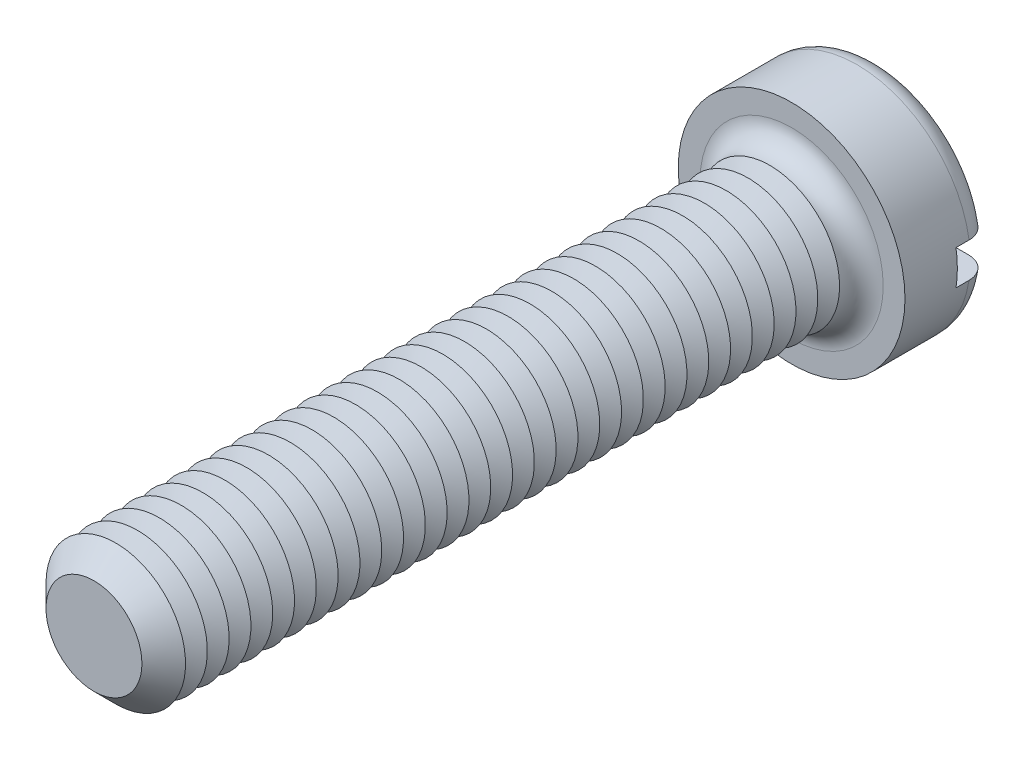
ISO-10303-21;
HEADER;
FILE_DESCRIPTION(('STEP AP214'),'2;1');
FILE_NAME('part.step','',(''),(''),'','','');
FILE_SCHEMA(('AUTOMOTIVE_DESIGN { 1 0 10303 214 1 1 1 1 }'));
ENDSEC;
DATA;
#1=APPLICATION_CONTEXT('core data for automotive mechanical design processes');
#2=APPLICATION_PROTOCOL_DEFINITION('international standard','automotive_design',2000,#1);
#3=PRODUCT_CONTEXT('',#1,'mechanical');
#4=PRODUCT('Part','Part','',(#3));
#5=PRODUCT_RELATED_PRODUCT_CATEGORY('part','',(#4));
#6=PRODUCT_DEFINITION_FORMATION('','',#4);
#7=PRODUCT_DEFINITION_CONTEXT('part definition',#1,'design');
#8=PRODUCT_DEFINITION('design','',#6,#7);
#9=PRODUCT_DEFINITION_SHAPE('','',#8);
#10=(LENGTH_UNIT() NAMED_UNIT(*) SI_UNIT(.MILLI.,.METRE.));
#11=(NAMED_UNIT(*) PLANE_ANGLE_UNIT() SI_UNIT($,.RADIAN.));
#12=(NAMED_UNIT(*) SI_UNIT($,.STERADIAN.) SOLID_ANGLE_UNIT());
#13=UNCERTAINTY_MEASURE_WITH_UNIT(LENGTH_MEASURE(1.E-05),#10,'distance_accuracy_value','');
#14=(GEOMETRIC_REPRESENTATION_CONTEXT(3) GLOBAL_UNCERTAINTY_ASSIGNED_CONTEXT((#13)) GLOBAL_UNIT_ASSIGNED_CONTEXT((#10,
#11,#12)) REPRESENTATION_CONTEXT('',''));
#15=CARTESIAN_POINT('',(0.,0.,0.));
#16=DIRECTION('',(0.,0.,1.));
#17=DIRECTION('',(1.,0.,0.));
#18=AXIS2_PLACEMENT_3D('',#15,#16,#17);
#19=CARTESIAN_POINT('',(0.,0.,-5.));
#20=DIRECTION('',(0.,0.,1.));
#21=DIRECTION('',(1.,0.,0.));
#22=AXIS2_PLACEMENT_3D('',#19,#20,#21);
#23=PLANE('',#22);
#24=CARTESIAN_POINT('',(0.,0.,-5.));
#25=DIRECTION('',(0.,0.,1.));
#26=DIRECTION('',(1.,0.,0.));
#27=AXIS2_PLACEMENT_3D('',#24,#25,#26);
#28=CIRCLE('',#27,5.25);
#29=CARTESIAN_POINT('',(-5.15388203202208,1.,-5.));
#30=VERTEX_POINT('',#29);
#31=CARTESIAN_POINT('',(5.15388203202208,1.,-5.));
#32=VERTEX_POINT('',#31);
#33=EDGE_CURVE('E116',#30,#32,#28,.F.);
#34=ORIENTED_EDGE('',*,*,#33,.T.);
#35=DIRECTION('',(1.,0.,0.));
#36=VECTOR('',#35,1.);
#37=CARTESIAN_POINT('',(-6.5,1.,-5.));
#38=LINE('',#37,#36);
#39=EDGE_CURVE('E111',#30,#32,#38,.T.);
#40=ORIENTED_EDGE('',*,*,#39,.F.);
#41=EDGE_LOOP('',(#34,#40));
#42=FACE_BOUND('',#41,.T.);
#43=ADVANCED_FACE('F39',(#42),#23,.F.);
#44=CARTESIAN_POINT('',(0.,0.,-3.75));
#45=DIRECTION('',(0.,0.,1.));
#46=DIRECTION('',(1.,0.,0.));
#47=AXIS2_PLACEMENT_3D('',#44,#45,#46);
#48=TOROIDAL_SURFACE('',#47,5.25,1.25);
#49=CARTESIAN_POINT('',(-6.04655789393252,1.,-4.63904490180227));
#50=CARTESIAN_POINT('',(-5.99546860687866,1.,-4.68885774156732));
#51=CARTESIAN_POINT('',(-5.94008472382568,1.,-4.73434760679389));
#52=CARTESIAN_POINT('',(-5.8223927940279,1.,-4.81538052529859));
#53=CARTESIAN_POINT('',(-5.7600753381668,1.,-4.85090982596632));
#54=CARTESIAN_POINT('',(-5.63044351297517,1.,-4.91100606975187));
#55=CARTESIAN_POINT('',(-5.56313479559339,1.,-4.93558519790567));
#56=CARTESIAN_POINT('',(-5.42539577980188,1.,-4.97322457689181));
#57=CARTESIAN_POINT('',(-5.35496625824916,1.,-4.98628767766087));
#58=CARTESIAN_POINT('',(-5.21212635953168,1.,-5.00070478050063));
#59=CARTESIAN_POINT('',(-5.13970265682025,1.,-5.00192674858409));
#60=CARTESIAN_POINT('',(-4.99565121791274,1.,-4.99234085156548));
#61=CARTESIAN_POINT('',(-4.92402357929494,1.,-4.98153152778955));
#62=CARTESIAN_POINT('',(-4.78274786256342,1.,-4.94801424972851));
#63=CARTESIAN_POINT('',(-4.71313137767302,1.,-4.92517296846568));
#64=CARTESIAN_POINT('',(-4.57871041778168,1.,-4.86813760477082));
#65=CARTESIAN_POINT('',(-4.51390612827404,1.,-4.83394308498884));
#66=CARTESIAN_POINT('',(-4.39095493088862,1.,-4.75508341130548));
#67=CARTESIAN_POINT('',(-4.33281197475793,1.,-4.7104120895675));
#68=CARTESIAN_POINT('',(-4.22499800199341,1.,-4.61179869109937));
#69=CARTESIAN_POINT('',(-4.17532640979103,1.,-4.55785724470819));
#70=CARTESIAN_POINT('',(-4.08677450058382,1.,-4.4431082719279));
#71=CARTESIAN_POINT('',(-4.0477350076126,1.,-4.38242369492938));
#72=CARTESIAN_POINT('',(-3.98074296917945,1.,-4.25521412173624));
#73=CARTESIAN_POINT('',(-3.95278836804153,1.,-4.18869021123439));
#74=CARTESIAN_POINT('',(-3.90959497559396,1.,-4.0537026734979));
#75=CARTESIAN_POINT('',(-3.89401985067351,1.,-3.98534663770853));
#76=CARTESIAN_POINT('',(-3.8748586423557,1.,-3.84697740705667));
#77=CARTESIAN_POINT('',(-3.87127067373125,1.,-3.7769644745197));
#78=CARTESIAN_POINT('',(-3.8761573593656,1.,-3.63892215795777));
#79=CARTESIAN_POINT('',(-3.88436651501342,1.,-3.57088319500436));
#80=CARTESIAN_POINT('',(-3.91207743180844,1.,-3.43714958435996));
#81=CARTESIAN_POINT('',(-3.93157911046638,1.,-3.37145491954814));
#82=CARTESIAN_POINT('',(-3.98125045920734,1.,-3.24411474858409));
#83=CARTESIAN_POINT('',(-4.01143761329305,1.,-3.18247607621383));
#84=CARTESIAN_POINT('',(-4.08150210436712,1.,-3.064981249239));
#85=CARTESIAN_POINT('',(-4.12138048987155,1.,-3.0091257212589));
#86=CARTESIAN_POINT('',(-4.2106718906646,1.,-2.90336353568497));
#87=CARTESIAN_POINT('',(-4.26028693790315,1.,-2.85362751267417));
#88=CARTESIAN_POINT('',(-4.36696587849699,1.,-2.76291710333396));
#89=CARTESIAN_POINT('',(-4.42403082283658,1.,-2.72194395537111));
#90=CARTESIAN_POINT('',(-4.54567957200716,1.,-2.64877280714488));
#91=CARTESIAN_POINT('',(-4.61042643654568,1.,-2.61684571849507));
#92=CARTESIAN_POINT('',(-4.74430563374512,1.,-2.56412359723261));
#93=CARTESIAN_POINT('',(-4.81343838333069,1.,-2.54332962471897));
#94=CARTESIAN_POINT('',(-4.95527237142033,1.,-2.51320471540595));
#95=CARTESIAN_POINT('',(-5.0280120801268,1.,-2.50405449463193));
#96=CARTESIAN_POINT('',(-5.17399775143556,1.,-2.49810126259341));
#97=CARTESIAN_POINT('',(-5.24724372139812,1.,-2.50129843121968));
#98=CARTESIAN_POINT('',(-5.3921014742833,1.,-2.52000776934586));
#99=CARTESIAN_POINT('',(-5.4637142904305,1.,-2.53551191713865));
#100=CARTESIAN_POINT('',(-5.60326680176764,1.,-2.57846304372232));
#101=CARTESIAN_POINT('',(-5.67120668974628,1.,-2.60590939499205));
#102=CARTESIAN_POINT('',(-5.80064060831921,1.,-2.67164926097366));
#103=CARTESIAN_POINT('',(-5.862199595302,1.,-2.7098148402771));
#104=CARTESIAN_POINT('',(-5.9779079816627,1.,-2.79608690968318));
#105=CARTESIAN_POINT('',(-6.03205795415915,1.,-2.84419263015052));
#106=CARTESIAN_POINT('',(-6.13055119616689,1.,-2.94820522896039));
#107=CARTESIAN_POINT('',(-6.17502887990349,1.,-3.00398483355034));
#108=CARTESIAN_POINT('',(-6.25384180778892,1.,-3.12230113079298));
#109=CARTESIAN_POINT('',(-6.28817779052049,1.,-3.18483733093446));
#110=CARTESIAN_POINT('',(-6.34527986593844,1.,-3.31401726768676));
#111=CARTESIAN_POINT('',(-6.36818984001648,1.,-3.38059742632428));
#112=CARTESIAN_POINT('',(-6.40240470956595,1.,-3.5166725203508));
#113=CARTESIAN_POINT('',(-6.41371067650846,1.,-3.58616718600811));
#114=CARTESIAN_POINT('',(-6.42433240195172,1.,-3.72550026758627));
#115=CARTESIAN_POINT('',(-6.4237441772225,1.,-3.79533138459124));
#116=CARTESIAN_POINT('',(-6.41082814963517,1.,-3.93391789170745));
#117=CARTESIAN_POINT('',(-6.39849757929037,1.,-4.00267302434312));
#118=CARTESIAN_POINT('',(-6.36249191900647,1.,-4.13704597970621));
#119=CARTESIAN_POINT('',(-6.33883072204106,1.,-4.20266753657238));
#120=CARTESIAN_POINT('',(-6.28088769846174,1.,-4.32897165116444));
#121=CARTESIAN_POINT('',(-6.24661890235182,1.,-4.38966015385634));
#122=CARTESIAN_POINT('',(-6.18404039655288,1.,-4.48163773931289));
#123=CARTESIAN_POINT('',(-6.15876600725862,1.,-4.51503333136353));
#124=CARTESIAN_POINT('',(-6.10500607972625,1.,-4.5791298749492));
#125=CARTESIAN_POINT('',(-6.07652056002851,1.,-4.60983084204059));
#126=CARTESIAN_POINT('',(-6.04655789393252,1.,-4.63904490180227));
#127=B_SPLINE_CURVE_WITH_KNOTS('',3,(#49,#50,#51,#52,#53,#54,#55,#56,#57,#58,#59,#60,#61,#62,
#63,#64,#65,#66,#67,#68,#69,#70,#71,#72,#73,#74,#75,#76,#77,#78,#79,#80,#81,#82,#83,#84,#85,#86,
#87,#88,#89,#90,#91,#92,#93,#94,#95,#96,#97,#98,#99,#100,#101,#102,#103,#104,#105,#106,#107,
#108,#109,#110,#111,#112,#113,#114,#115,#116,#117,#118,#119,#120,#121,#122,#123,#124,#125,#126),
.UNSPECIFIED.,.T.,.F.,(4,2,2,2,2,2,2,2,2,2,2,2,2,2,2,2,2,2,2,2,2,2,2,2,2,2,2,2,2,2,2,2,2,2,2,2,
2,2,4),(0.,0.213907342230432,0.428108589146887,0.642070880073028,0.855980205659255,
1.07227200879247,1.28859003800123,1.50735715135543,1.72613269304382,1.94503735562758,
2.16392713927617,2.37933295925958,2.59469881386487,2.80399176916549,3.01325180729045,
3.2178754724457,3.42249764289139,3.62745618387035,3.83243690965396,4.04223444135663,
4.25206160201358,4.46763253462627,4.68322399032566,4.90212226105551,5.12102372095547,
5.33978261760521,5.55853002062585,5.77477015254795,5.99099354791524,6.20398686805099,
6.41696467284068,6.62718821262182,6.83739233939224,7.0459002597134,7.25445733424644,
7.46275934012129,7.67080647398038,7.79625882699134,7.92171045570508),.UNSPECIFIED.);
#128=CARTESIAN_POINT('',(-6.42261628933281,1.,-3.74999999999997));
#129=VERTEX_POINT('',#128);
#130=EDGE_CURVE('E418',#129,#30,#127,.T.);
#131=ORIENTED_EDGE('',*,*,#130,.F.);
#132=CARTESIAN_POINT('',(0.,0.,-3.75));
#133=DIRECTION('',(0.,0.,1.));
#134=DIRECTION('',(1.,0.,0.));
#135=AXIS2_PLACEMENT_3D('',#132,#133,#134);
#136=CIRCLE('',#135,6.5);
#137=CARTESIAN_POINT('',(6.42261628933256,1.,-3.75));
#138=VERTEX_POINT('',#137);
#139=EDGE_CURVE('E124',#138,#129,#136,.T.);
#140=ORIENTED_EDGE('',*,*,#139,.F.);
#141=CARTESIAN_POINT('',(4.06944999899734,1.,-4.4133199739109));
#142=CARTESIAN_POINT('',(4.10828271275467,1.,-4.47354709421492));
#143=CARTESIAN_POINT('',(4.15233880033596,1.,-4.53047894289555));
#144=CARTESIAN_POINT('',(4.24946916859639,1.,-4.63614530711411));
#145=CARTESIAN_POINT('',(4.3025574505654,1.,-4.68486685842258));
#146=CARTESIAN_POINT('',(4.41603250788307,1.,-4.77271114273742));
#147=CARTESIAN_POINT('',(4.47640839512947,1.,-4.8118479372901));
#148=CARTESIAN_POINT('',(4.60277035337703,1.,-4.87959878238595));
#149=CARTESIAN_POINT('',(4.66875480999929,1.,-4.90821584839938));
#150=CARTESIAN_POINT('',(4.80558589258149,1.,-4.95456537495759));
#151=CARTESIAN_POINT('',(4.87649196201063,1.,-4.97212253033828));
#152=CARTESIAN_POINT('',(5.02024710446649,1.,-4.99514979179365));
#153=CARTESIAN_POINT('',(5.09309636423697,1.,-5.00061873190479));
#154=CARTESIAN_POINT('',(5.23902872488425,1.,-4.99926689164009));
#155=CARTESIAN_POINT('',(5.31211131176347,1.,-4.99238812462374));
#156=CARTESIAN_POINT('',(5.45605806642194,1.,-4.96635140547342));
#157=CARTESIAN_POINT('',(5.52692231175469,1.,-4.94719388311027));
#158=CARTESIAN_POINT('',(5.66376170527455,1.,-4.89728421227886));
#159=CARTESIAN_POINT('',(5.72977335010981,1.,-4.86663219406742));
#160=CARTESIAN_POINT('',(5.85560715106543,1.,-4.79452334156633));
#161=CARTESIAN_POINT('',(5.91542977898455,1.,-4.7530673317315));
#162=CARTESIAN_POINT('',(6.02626022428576,1.,-4.66116821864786));
#163=CARTESIAN_POINT('',(6.07738307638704,1.,-4.6108638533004));
#164=CARTESIAN_POINT('',(6.17030947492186,1.,-4.50227823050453));
#165=CARTESIAN_POINT('',(6.2121137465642,1.,-4.44399759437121));
#166=CARTESIAN_POINT('',(6.28460268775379,1.,-4.32200305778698));
#167=CARTESIAN_POINT('',(6.31543589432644,1.,-4.2583773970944));
#168=CARTESIAN_POINT('',(6.36586009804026,1.,-4.12681721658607));
#169=CARTESIAN_POINT('',(6.38545178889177,1.,-4.0588829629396));
#170=CARTESIAN_POINT('',(6.41265760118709,1.,-3.92136007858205));
#171=CARTESIAN_POINT('',(6.42038873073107,1.,-3.85179457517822));
#172=CARTESIAN_POINT('',(6.42401070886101,1.,-3.7123569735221));
#173=CARTESIAN_POINT('',(6.41990193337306,1.,-3.64248488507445));
#174=CARTESIAN_POINT('',(6.40000894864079,1.,-3.50470871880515));
#175=CARTESIAN_POINT('',(6.38427119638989,1.,-3.43679792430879));
#176=CARTESIAN_POINT('',(6.34164491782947,1.,-3.30457296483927));
#177=CARTESIAN_POINT('',(6.31475638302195,1.,-3.24025880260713));
#178=CARTESIAN_POINT('',(6.2505455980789,1.,-3.11686791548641));
#179=CARTESIAN_POINT('',(6.21319759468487,1.,-3.05780459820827));
#180=CARTESIAN_POINT('',(6.12919411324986,1.,-2.94671919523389));
#181=CARTESIAN_POINT('',(6.08253833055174,1.,-2.89469734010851));
#182=CARTESIAN_POINT('',(5.98083387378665,1.,-2.79868150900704));
#183=CARTESIAN_POINT('',(5.92571704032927,1.,-2.75475975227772));
#184=CARTESIAN_POINT('',(5.80897194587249,1.,-2.67665277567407));
#185=CARTESIAN_POINT('',(5.74734329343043,1.,-2.64246814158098));
#186=CARTESIAN_POINT('',(5.6184644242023,1.,-2.58431810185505));
#187=CARTESIAN_POINT('',(5.55115102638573,1.,-2.56049275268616));
#188=CARTESIAN_POINT('',(5.41351272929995,1.,-2.52429868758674));
#189=CARTESIAN_POINT('',(5.34318759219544,1.,-2.51193087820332));
#190=CARTESIAN_POINT('',(5.20041507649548,1.,-2.49882112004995));
#191=CARTESIAN_POINT('',(5.12795169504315,1.,-2.49825332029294));
#192=CARTESIAN_POINT('',(4.98393373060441,1.,-2.50914771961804));
#193=CARTESIAN_POINT('',(4.91237921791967,1.,-2.52061084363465));
#194=CARTESIAN_POINT('',(4.77137358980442,1.,-2.55542281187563));
#195=CARTESIAN_POINT('',(4.70195472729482,1.,-2.57890245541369));
#196=CARTESIAN_POINT('',(4.56803538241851,1.,-2.63717701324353));
#197=CARTESIAN_POINT('',(4.50353509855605,1.,-2.67197238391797));
#198=CARTESIAN_POINT('',(4.38131858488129,1.,-2.7519648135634));
#199=CARTESIAN_POINT('',(4.32360365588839,1.,-2.79716386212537));
#200=CARTESIAN_POINT('',(4.21673400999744,1.,-2.89675634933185));
#201=CARTESIAN_POINT('',(4.16757871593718,1.,-2.95114916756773));
#202=CARTESIAN_POINT('',(4.08014713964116,1.,-3.06667703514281));
#203=CARTESIAN_POINT('',(4.04170608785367,1.,-3.12768727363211));
#204=CARTESIAN_POINT('',(3.97596192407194,1.,-3.25543782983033));
#205=CARTESIAN_POINT('',(3.94865624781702,1.,-3.32217682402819));
#206=CARTESIAN_POINT('',(3.9067737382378,1.,-3.45745603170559));
#207=CARTESIAN_POINT('',(3.89185707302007,1.,-3.52589108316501));
#208=CARTESIAN_POINT('',(3.87400755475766,1.,-3.66432360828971));
#209=CARTESIAN_POINT('',(3.87107601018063,1.,-3.73432125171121));
#210=CARTESIAN_POINT('',(3.8772387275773,1.,-3.87228267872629));
#211=CARTESIAN_POINT('',(3.88607933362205,1.,-3.94025811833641));
#212=CARTESIAN_POINT('',(3.91502769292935,1.,-4.07370133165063));
#213=CARTESIAN_POINT('',(3.93512131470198,1.,-4.1391721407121));
#214=CARTESIAN_POINT('',(3.9752037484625,1.,-4.23926719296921));
#215=CARTESIAN_POINT('',(3.99171171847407,1.,-4.27532618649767));
#216=CARTESIAN_POINT('',(4.02809737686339,1.,-4.34569933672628));
#217=CARTESIAN_POINT('',(4.04797497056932,1.,-4.3800135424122));
#218=CARTESIAN_POINT('',(4.06944999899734,1.,-4.4133199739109));
#219=B_SPLINE_CURVE_WITH_KNOTS('',3,(#141,#142,#143,#144,#145,#146,#147,#148,#149,#150,#151,
#152,#153,#154,#155,#156,#157,#158,#159,#160,#161,#162,#163,#164,#165,#166,#167,#168,#169,#170,
#171,#172,#173,#174,#175,#176,#177,#178,#179,#180,#181,#182,#183,#184,#185,#186,#187,#188,#189,
#190,#191,#192,#193,#194,#195,#196,#197,#198,#199,#200,#201,#202,#203,#204,#205,#206,#207,#208,
#209,#210,#211,#212,#213,#214,#215,#216,#217,#218),.UNSPECIFIED.,.T.,.F.,(4,2,2,2,2,2,2,2,2,2,2,
2,2,2,2,2,2,2,2,2,2,2,2,2,2,2,2,2,2,2,2,2,2,2,2,2,2,2,4),(0.,0.214833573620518,
0.430003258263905,0.644855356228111,0.859645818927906,1.0777603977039,1.29589601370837,
1.51505870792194,1.73421373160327,1.95150241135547,2.16877451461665,2.38290237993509,
2.59701357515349,2.8081044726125,3.01918234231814,3.22816416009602,3.43713934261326,
3.64528416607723,3.85342914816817,4.06209119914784,4.27076008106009,4.48120788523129,
4.69166834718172,4.90489186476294,5.11813225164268,5.33451752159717,5.55091942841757,
5.76972860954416,5.98854661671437,6.20740650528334,6.42625163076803,6.64151774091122,
6.85673425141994,7.0658317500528,7.27495207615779,7.47963858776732,7.68406862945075,
7.80287790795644,7.92168384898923),.UNSPECIFIED.);
#220=EDGE_CURVE('E420',#32,#138,#219,.T.);
#221=ORIENTED_EDGE('',*,*,#220,.F.);
#222=ORIENTED_EDGE('',*,*,#33,.F.);
#223=EDGE_LOOP('',(#131,#140,#221,#222));
#224=FACE_BOUND('',#223,.T.);
#225=ADVANCED_FACE('F402',(#224),#48,.T.);
#226=CARTESIAN_POINT('',(0.,0.,-5.));
#227=DIRECTION('',(0.,0.,1.));
#228=DIRECTION('',(1.,0.,0.));
#229=AXIS2_PLACEMENT_3D('',#226,#227,#228);
#230=CYLINDRICAL_SURFACE('',#229,6.5);
#231=DIRECTION('',(0.,0.,1.));
#232=VECTOR('',#231,1.);
#233=CARTESIAN_POINT('',(6.42261628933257,1.,-5.));
#234=LINE('',#233,#232);
#235=CARTESIAN_POINT('',(6.42261628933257,1.,-3.));
#236=VERTEX_POINT('',#235);
#237=EDGE_CURVE('E436',#138,#236,#234,.T.);
#238=ORIENTED_EDGE('',*,*,#237,.F.);
#239=ORIENTED_EDGE('',*,*,#139,.T.);
#240=DIRECTION('',(0.,0.,1.));
#241=VECTOR('',#240,1.);
#242=CARTESIAN_POINT('',(-6.42261628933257,1.,-5.));
#243=LINE('',#242,#241);
#244=CARTESIAN_POINT('',(-6.42261628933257,1.,-3.));
#245=VERTEX_POINT('',#244);
#246=EDGE_CURVE('E63',#245,#129,#243,.F.);
#247=ORIENTED_EDGE('',*,*,#246,.F.);
#248=CARTESIAN_POINT('',(0.,0.,-3.));
#249=DIRECTION('',(0.,0.,-1.));
#250=DIRECTION('',(-1.,0.,0.));
#251=AXIS2_PLACEMENT_3D('',#248,#249,#250);
#252=CIRCLE('',#251,6.5);
#253=CARTESIAN_POINT('',(-6.42261628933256,-0.999999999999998,-3.));
#254=VERTEX_POINT('',#253);
#255=EDGE_CURVE('E43',#245,#254,#252,.F.);
#256=ORIENTED_EDGE('',*,*,#255,.T.);
#257=DIRECTION('',(0.,0.,1.));
#258=VECTOR('',#257,1.);
#259=CARTESIAN_POINT('',(-6.42261628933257,-0.999999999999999,-5.));
#260=LINE('',#259,#258);
#261=CARTESIAN_POINT('',(-6.42261628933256,-0.999999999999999,-3.75));
#262=VERTEX_POINT('',#261);
#263=EDGE_CURVE('E433',#262,#254,#260,.T.);
#264=ORIENTED_EDGE('',*,*,#263,.F.);
#265=CARTESIAN_POINT('',(6.42261628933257,-1.,-3.75));
#266=VERTEX_POINT('',#265);
#267=EDGE_CURVE('E126',#262,#266,#136,.T.);
#268=ORIENTED_EDGE('',*,*,#267,.T.);
#269=DIRECTION('',(0.,0.,1.));
#270=VECTOR('',#269,1.);
#271=CARTESIAN_POINT('',(6.42261628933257,-1.,-5.));
#272=LINE('',#271,#270);
#273=CARTESIAN_POINT('',(6.42261628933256,-1.,-3.));
#274=VERTEX_POINT('',#273);
#275=EDGE_CURVE('E55',#274,#266,#272,.F.);
#276=ORIENTED_EDGE('',*,*,#275,.F.);
#277=EDGE_CURVE('E11',#274,#236,#252,.F.);
#278=ORIENTED_EDGE('',*,*,#277,.T.);
#279=EDGE_LOOP('',(#238,#239,#247,#256,#264,#268,#276,#278));
#280=FACE_BOUND('',#279,.T.);
#281=CARTESIAN_POINT('',(0.,0.,0.));
#282=DIRECTION('',(0.,0.,1.));
#283=DIRECTION('',(1.,0.,0.));
#284=AXIS2_PLACEMENT_3D('',#281,#282,#283);
#285=CIRCLE('',#284,6.5);
#286=CARTESIAN_POINT('',(6.5,0.,0.));
#287=VERTEX_POINT('',#286);
#288=EDGE_CURVE('E439',#287,#287,#285,.T.);
#289=ORIENTED_EDGE('',*,*,#288,.F.);
#290=EDGE_LOOP('',(#289));
#291=FACE_BOUND('',#290,.T.);
#292=ADVANCED_FACE('F398',(#280,#291),#230,.T.);
#293=CARTESIAN_POINT('',(5.15388203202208,-1.,-5.));
#294=VERTEX_POINT('',#293);
#295=CARTESIAN_POINT('',(-5.15388203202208,-0.999999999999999,-5.));
#296=VERTEX_POINT('',#295);
#297=EDGE_CURVE('E109',#294,#296,#28,.F.);
#298=ORIENTED_EDGE('',*,*,#297,.T.);
#299=DIRECTION('',(-1.,0.,0.));
#300=VECTOR('',#299,1.);
#301=CARTESIAN_POINT('',(-6.5,-0.999999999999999,-5.));
#302=LINE('',#301,#300);
#303=EDGE_CURVE('E96',#294,#296,#302,.T.);
#304=ORIENTED_EDGE('',*,*,#303,.F.);
#305=EDGE_LOOP('',(#298,#304));
#306=FACE_BOUND('',#305,.T.);
#307=ADVANCED_FACE('F108',(#306),#23,.F.);
#308=CARTESIAN_POINT('',(0.,0.,0.));
#309=DIRECTION('',(0.,0.,1.));
#310=DIRECTION('',(1.,0.,0.));
#311=AXIS2_PLACEMENT_3D('',#308,#309,#310);
#312=PLANE('',#311);
#313=CARTESIAN_POINT('',(0.,0.,0.));
#314=DIRECTION('',(0.,0.,1.));
#315=DIRECTION('',(1.,0.,0.));
#316=AXIS2_PLACEMENT_3D('',#313,#314,#315);
#317=CIRCLE('',#316,5.25);
#318=CARTESIAN_POINT('',(5.25,0.,0.));
#319=VERTEX_POINT('',#318);
#320=EDGE_CURVE('E115',#319,#319,#317,.F.);
#321=ORIENTED_EDGE('',*,*,#320,.T.);
#322=EDGE_LOOP('',(#321));
#323=FACE_BOUND('',#322,.T.);
#324=ORIENTED_EDGE('',*,*,#288,.T.);
#325=EDGE_LOOP('',(#324));
#326=FACE_BOUND('',#325,.T.);
#327=ADVANCED_FACE('F397',(#323,#326),#312,.T.);
#328=CARTESIAN_POINT('',(-6.04655789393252,-0.999999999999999,-4.63904490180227));
#329=CARTESIAN_POINT('',(-6.0966604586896,-0.999999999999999,-4.59018532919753));
#330=CARTESIAN_POINT('',(-6.14270501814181,-0.999999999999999,-4.53709744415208));
#331=CARTESIAN_POINT('',(-6.22528519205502,-0.999999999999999,-4.42391631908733));
#332=CARTESIAN_POINT('',(-6.26181074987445,-0.999999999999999,-4.36381576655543));
#333=CARTESIAN_POINT('',(-6.32422109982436,-0.999999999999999,-4.23831836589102));
#334=CARTESIAN_POINT('',(-6.35010658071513,-0.999999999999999,-4.17292186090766));
#335=CARTESIAN_POINT('',(-6.39044668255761,-0.999999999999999,-4.03870925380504));
#336=CARTESIAN_POINT('',(-6.40490396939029,-0.999999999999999,-3.96989395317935));
#337=CARTESIAN_POINT('',(-6.42190814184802,-0.999999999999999,-3.83122595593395));
#338=CARTESIAN_POINT('',(-6.4245257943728,-0.999999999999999,-3.76138193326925));
#339=CARTESIAN_POINT('',(-6.41796432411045,-0.999999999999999,-3.62224935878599));
#340=CARTESIAN_POINT('',(-6.40878509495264,-0.999999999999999,-3.55296081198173));
#341=CARTESIAN_POINT('',(-6.37894560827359,-0.999999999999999,-3.41709241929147));
#342=CARTESIAN_POINT('',(-6.35831520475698,-0.999999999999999,-3.35050601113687));
#343=CARTESIAN_POINT('',(-6.30620980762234,-0.999999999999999,-3.22172312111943));
#344=CARTESIAN_POINT('',(-6.2747347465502,-0.999999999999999,-3.15952666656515));
#345=CARTESIAN_POINT('',(-6.20172710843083,-0.999999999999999,-3.04101762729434));
#346=CARTESIAN_POINT('',(-6.16015622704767,-0.999999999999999,-2.98472864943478));
#347=CARTESIAN_POINT('',(-6.06823774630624,-0.999999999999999,-2.87984578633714));
#348=CARTESIAN_POINT('',(-6.01788981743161,-0.999999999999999,-2.83125219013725));
#349=CARTESIAN_POINT('',(-5.90933830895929,-0.999999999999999,-2.74262118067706));
#350=CARTESIAN_POINT('',(-5.85106338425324,-0.999999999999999,-2.70267117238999));
#351=CARTESIAN_POINT('',(-5.72870702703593,-0.999999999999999,-2.63296796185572));
#352=CARTESIAN_POINT('',(-5.66462521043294,-0.999999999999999,-2.6032154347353));
#353=CARTESIAN_POINT('',(-5.53153273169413,-0.999999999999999,-2.55430842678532));
#354=CARTESIAN_POINT('',(-5.46246626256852,-0.999999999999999,-2.53530583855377));
#355=CARTESIAN_POINT('',(-5.32214267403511,-0.999999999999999,-2.5089831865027));
#356=CARTESIAN_POINT('',(-5.25088537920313,-0.999999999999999,-2.50166406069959));
#357=CARTESIAN_POINT('',(-5.10710123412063,-0.999999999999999,-2.49882202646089));
#358=CARTESIAN_POINT('',(-5.03457095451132,-0.999999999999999,-2.50347166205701));
#359=CARTESIAN_POINT('',(-4.8912897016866,-0.999999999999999,-2.52476029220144));
#360=CARTESIAN_POINT('',(-4.82053886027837,-0.999999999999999,-2.54140017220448));
#361=CARTESIAN_POINT('',(-4.68213257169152,-0.999999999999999,-2.58641614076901));
#362=CARTESIAN_POINT('',(-4.61451256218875,-0.999999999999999,-2.61490131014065));
#363=CARTESIAN_POINT('',(-4.48502801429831,-0.999999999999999,-2.68285095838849));
#364=CARTESIAN_POINT('',(-4.42316359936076,-0.999999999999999,-2.72231567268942));
#365=CARTESIAN_POINT('',(-4.30720694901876,-0.999999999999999,-2.81103994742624));
#366=CARTESIAN_POINT('',(-4.25309118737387,-0.999999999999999,-2.86026872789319));
#367=CARTESIAN_POINT('',(-4.15409408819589,-0.999999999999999,-2.9672764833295));
#368=CARTESIAN_POINT('',(-4.10921182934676,-0.999999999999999,-3.02505460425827));
#369=CARTESIAN_POINT('',(-4.03096584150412,-0.999999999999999,-3.14632492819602));
#370=CARTESIAN_POINT('',(-3.99739097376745,-0.999999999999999,-3.2096807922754));
#371=CARTESIAN_POINT('',(-3.94171839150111,-0.999999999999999,-3.34124912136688));
#372=CARTESIAN_POINT('',(-3.91961840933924,-0.999999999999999,-3.40946062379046));
#373=CARTESIAN_POINT('',(-3.88816636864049,-0.999999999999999,-3.54669256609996));
#374=CARTESIAN_POINT('',(-3.87846562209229,-0.999999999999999,-3.61563318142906));
#375=CARTESIAN_POINT('',(-3.87100568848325,-0.999999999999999,-3.75415397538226));
#376=CARTESIAN_POINT('',(-3.87324501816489,-0.999999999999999,-3.82373407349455));
#377=CARTESIAN_POINT('',(-3.88943589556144,-0.999999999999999,-3.96027701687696));
#378=CARTESIAN_POINT('',(-3.90318225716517,-0.999999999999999,-4.0272643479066));
#379=CARTESIAN_POINT('',(-3.94163954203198,-0.999999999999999,-4.1580093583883));
#380=CARTESIAN_POINT('',(-3.96635075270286,-0.999999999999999,-4.22176695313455));
#381=CARTESIAN_POINT('',(-4.026160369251,-0.999999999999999,-4.34483320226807));
#382=CARTESIAN_POINT('',(-4.06134035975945,-0.999999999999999,-4.40410214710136));
#383=CARTESIAN_POINT('',(-4.14090865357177,-0.999999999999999,-4.51609417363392));
#384=CARTESIAN_POINT('',(-4.18529811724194,-0.999999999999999,-4.56881642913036));
#385=CARTESIAN_POINT('',(-4.2832649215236,-0.999999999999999,-4.66770177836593));
#386=CARTESIAN_POINT('',(-4.33705327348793,-0.999999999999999,-4.71365579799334));
#387=CARTESIAN_POINT('',(-4.45141776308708,-0.999999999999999,-4.79615385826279));
#388=CARTESIAN_POINT('',(-4.51199483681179,-0.999999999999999,-4.83269659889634));
#389=CARTESIAN_POINT('',(-4.63989216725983,-0.999999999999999,-4.89626962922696));
#390=CARTESIAN_POINT('',(-4.70734508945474,-0.999999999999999,-4.92303326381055));
#391=CARTESIAN_POINT('',(-4.84575497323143,-0.999999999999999,-4.96500199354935));
#392=CARTESIAN_POINT('',(-4.91671207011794,-0.999999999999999,-4.98020664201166));
#393=CARTESIAN_POINT('',(-5.06097761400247,-0.999999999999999,-4.9987306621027));
#394=CARTESIAN_POINT('',(-5.13430353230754,-0.999999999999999,-5.00191441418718));
#395=CARTESIAN_POINT('',(-5.28046546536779,-0.999999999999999,-4.99587686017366));
#396=CARTESIAN_POINT('',(-5.35330135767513,-0.999999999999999,-4.98665256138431));
#397=CARTESIAN_POINT('',(-5.49610354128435,-0.999999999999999,-4.95604184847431));
#398=CARTESIAN_POINT('',(-5.56607890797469,-0.999999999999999,-4.93469772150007));
#399=CARTESIAN_POINT('',(-5.70131538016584,-0.999999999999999,-4.88041956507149));
#400=CARTESIAN_POINT('',(-5.76658233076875,-0.999999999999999,-4.84750021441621));
#401=CARTESIAN_POINT('',(-5.86782577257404,-0.999999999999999,-4.78498748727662));
#402=CARTESIAN_POINT('',(-5.90579749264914,-0.999999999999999,-4.75856648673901));
#403=CARTESIAN_POINT('',(-5.97862186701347,-0.999999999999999,-4.70172646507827));
#404=CARTESIAN_POINT('',(-6.0134745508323,-0.999999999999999,-4.6713074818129));
#405=CARTESIAN_POINT('',(-6.04655789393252,-0.999999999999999,-4.63904490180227));
#406=B_SPLINE_CURVE_WITH_KNOTS('',3,(#328,#329,#330,#331,#332,#333,#334,#335,#336,#337,#338,
#339,#340,#341,#342,#343,#344,#345,#346,#347,#348,#349,#350,#351,#352,#353,#354,#355,#356,#357,
#358,#359,#360,#361,#362,#363,#364,#365,#366,#367,#368,#369,#370,#371,#372,#373,#374,#375,#376,
#377,#378,#379,#380,#381,#382,#383,#384,#385,#386,#387,#388,#389,#390,#391,#392,#393,#394,#395,
#396,#397,#398,#399,#400,#401,#402,#403,#404,#405),.UNSPECIFIED.,.T.,.F.,(4,2,2,2,2,2,2,2,2,2,2,
2,2,2,2,2,2,2,2,2,2,2,2,2,2,2,2,2,2,2,2,2,2,2,2,2,2,2,4),(0.,0.209780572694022,
0.419781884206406,0.629769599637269,0.839708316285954,1.04839053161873,1.2570746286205,
1.46521720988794,1.67336108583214,1.88230736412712,2.09126148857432,2.30223890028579,
2.51323027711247,2.72713284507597,2.94105258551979,3.15807345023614,3.37511034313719,
3.59419176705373,3.81327788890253,4.03168404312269,4.25006839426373,4.46411376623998,
4.67811682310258,4.88595885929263,5.09377507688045,5.29796268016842,5.50215563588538,
5.70798353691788,5.91383738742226,6.12510741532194,6.33640661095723,6.55309998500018,
6.76980173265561,6.98894112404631,7.20813337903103,7.42656551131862,7.64472163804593,
7.78324365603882,7.92176436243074),.UNSPECIFIED.);
#407=EDGE_CURVE('E103',#296,#262,#406,.T.);
#408=ORIENTED_EDGE('',*,*,#407,.F.);
#409=ORIENTED_EDGE('',*,*,#297,.F.);
#410=CARTESIAN_POINT('',(4.06944999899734,-1.,-4.4133199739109));
#411=CARTESIAN_POINT('',(4.03213207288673,-1.,-4.3554312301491));
#412=CARTESIAN_POINT('',(3.9995849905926,-1.,-4.29441722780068));
#413=CARTESIAN_POINT('',(3.94511822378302,-1.,-4.16776604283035));
#414=CARTESIAN_POINT('',(3.92320762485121,-1.,-4.10212496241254));
#415=CARTESIAN_POINT('',(3.89078811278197,-1.,-3.96804412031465));
#416=CARTESIAN_POINT('',(3.88028409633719,-1.,-3.89960316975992));
#417=CARTESIAN_POINT('',(3.87107895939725,-1.,-3.76194650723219));
#418=CARTESIAN_POINT('',(3.87237511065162,-1.,-3.69273097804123));
#419=CARTESIAN_POINT('',(3.88662927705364,-1.,-3.55634460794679));
#420=CARTESIAN_POINT('',(3.89944923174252,-1.,-3.48915926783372));
#421=CARTESIAN_POINT('',(3.93611188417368,-1.,-3.35786953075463));
#422=CARTESIAN_POINT('',(3.95995518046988,-1.,-3.29376530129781));
#423=CARTESIAN_POINT('',(4.0180748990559,-1.,-3.16993562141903));
#424=CARTESIAN_POINT('',(4.05242297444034,-1.,-3.11024385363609));
#425=CARTESIAN_POINT('',(4.13041121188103,-1.,-2.9972793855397));
#426=CARTESIAN_POINT('',(4.17405248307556,-1.,-2.94400745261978));
#427=CARTESIAN_POINT('',(4.27058636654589,-1.,-2.8439150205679));
#428=CARTESIAN_POINT('',(4.32368948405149,-1.,-2.79729757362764));
#429=CARTESIAN_POINT('',(4.43679856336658,-1.,-2.71336600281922));
#430=CARTESIAN_POINT('',(4.49680546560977,-1.,-2.67605314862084));
#431=CARTESIAN_POINT('',(4.62370121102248,-1.,-2.61081752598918));
#432=CARTESIAN_POINT('',(4.69072799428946,-1.,-2.58316284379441));
#433=CARTESIAN_POINT('',(4.82843981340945,-1.,-2.5393441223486));
#434=CARTESIAN_POINT('',(4.899125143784,-1.,-2.52318100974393));
#435=CARTESIAN_POINT('',(5.04306377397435,-1.,-2.50267755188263));
#436=CARTESIAN_POINT('',(5.11633773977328,-1.,-2.49848181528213));
#437=CARTESIAN_POINT('',(5.26254809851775,-1.,-2.50249357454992));
#438=CARTESIAN_POINT('',(5.33548449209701,-1.,-2.51070104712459));
#439=CARTESIAN_POINT('',(5.4786703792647,-1.,-2.53930888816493));
#440=CARTESIAN_POINT('',(5.54892819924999,-1.,-2.5596675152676));
#441=CARTESIAN_POINT('',(5.68495799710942,-1.,-2.61204238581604));
#442=CARTESIAN_POINT('',(5.75073024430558,-1.,-2.64405792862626));
#443=CARTESIAN_POINT('',(5.8750178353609,-1.,-2.7184150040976));
#444=CARTESIAN_POINT('',(5.93361487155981,-1.,-2.76061995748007));
#445=CARTESIAN_POINT('',(6.04275377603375,-1.,-2.85440601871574));
#446=CARTESIAN_POINT('',(6.09329629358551,-1.,-2.90598637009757));
#447=CARTESIAN_POINT('',(6.18409572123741,-1.,-3.01622977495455));
#448=CARTESIAN_POINT('',(6.2244945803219,-1.,-3.07477592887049));
#449=CARTESIAN_POINT('',(6.29474798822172,-1.,-3.19788594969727));
#450=CARTESIAN_POINT('',(6.3246032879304,-1.,-3.26244938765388));
#451=CARTESIAN_POINT('',(6.37256001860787,-1.,-3.39491634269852));
#452=CARTESIAN_POINT('',(6.39079949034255,-1.,-3.46276990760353));
#453=CARTESIAN_POINT('',(6.41554133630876,-1.,-3.60058363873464));
#454=CARTESIAN_POINT('',(6.42204424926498,-1.,-3.67054370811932));
#455=CARTESIAN_POINT('',(6.42311237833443,-1.,-3.81007982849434));
#456=CARTESIAN_POINT('',(6.41775799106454,-1.,-3.879655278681));
#457=CARTESIAN_POINT('',(6.39543799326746,-1.,-4.01691664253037));
#458=CARTESIAN_POINT('',(6.3784725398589,-1.,-4.08460258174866));
#459=CARTESIAN_POINT('',(6.33344768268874,-1.,-4.21614537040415));
#460=CARTESIAN_POINT('',(6.30539273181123,-1.,-4.28000374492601));
#461=CARTESIAN_POINT('',(6.23902076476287,-1.,-4.40214140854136));
#462=CARTESIAN_POINT('',(6.20070356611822,-1.,-4.46042059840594));
#463=CARTESIAN_POINT('',(6.11467174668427,-1.,-4.5701315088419));
#464=CARTESIAN_POINT('',(6.06690270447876,-1.,-4.62152053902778));
#465=CARTESIAN_POINT('',(5.96350111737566,-1.,-4.715657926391));
#466=CARTESIAN_POINT('',(5.90786817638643,-1.,-4.75840584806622));
#467=CARTESIAN_POINT('',(5.78965380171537,-1.,-4.8345781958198));
#468=CARTESIAN_POINT('',(5.72700078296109,-1.,-4.86789149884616));
#469=CARTESIAN_POINT('',(5.59704977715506,-1.,-4.92369754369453));
#470=CARTESIAN_POINT('',(5.52975144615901,-1.,-4.94618948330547));
#471=CARTESIAN_POINT('',(5.39137621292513,-1.,-4.98006173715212));
#472=CARTESIAN_POINT('',(5.32025859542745,-1.,-4.99127571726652));
#473=CARTESIAN_POINT('',(5.17715081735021,-1.,-5.00177798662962));
#474=CARTESIAN_POINT('',(5.10516061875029,-1.,-5.00106575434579));
#475=CARTESIAN_POINT('',(4.96131924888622,-1.,-4.98769775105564));
#476=CARTESIAN_POINT('',(4.88948297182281,-1.,-4.97488146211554));
#477=CARTESIAN_POINT('',(4.74893184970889,-1.,-4.93744335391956));
#478=CARTESIAN_POINT('',(4.68021795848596,-1.,-4.91281795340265));
#479=CARTESIAN_POINT('',(4.54744428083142,-1.,-4.8522329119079));
#480=CARTESIAN_POINT('',(4.48341761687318,-1.,-4.81620070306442));
#481=CARTESIAN_POINT('',(4.36244497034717,-1.,-4.73383277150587));
#482=CARTESIAN_POINT('',(4.30549069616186,-1.,-4.68750929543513));
#483=CARTESIAN_POINT('',(4.21823158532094,-1.,-4.60311228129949));
#484=CARTESIAN_POINT('',(4.18544074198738,-1.,-4.56757118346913));
#485=CARTESIAN_POINT('',(4.12413461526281,-1.,-4.49297229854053));
#486=CARTESIAN_POINT('',(4.09561926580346,-1.,-4.45391456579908));
#487=CARTESIAN_POINT('',(4.06944999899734,-1.,-4.4133199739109));
#488=B_SPLINE_CURVE_WITH_KNOTS('',3,(#410,#411,#412,#413,#414,#415,#416,#417,#418,#419,#420,
#421,#422,#423,#424,#425,#426,#427,#428,#429,#430,#431,#432,#433,#434,#435,#436,#437,#438,#439,
#440,#441,#442,#443,#444,#445,#446,#447,#448,#449,#450,#451,#452,#453,#454,#455,#456,#457,#458,
#459,#460,#461,#462,#463,#464,#465,#466,#467,#468,#469,#470,#471,#472,#473,#474,#475,#476,#477,
#478,#479,#480,#481,#482,#483,#484,#485,#486,#487),.UNSPECIFIED.,.T.,.F.,(4,2,2,2,2,2,2,2,2,2,2,
2,2,2,2,2,2,2,2,2,2,2,2,2,2,2,2,2,2,2,2,2,2,2,2,2,2,2,4),(0.,0.206453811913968,0.4130836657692,
0.619802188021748,0.826472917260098,1.03070015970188,1.23493849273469,1.44060223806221,
1.64629054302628,1.85731119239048,2.06836062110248,2.28487349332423,2.5014038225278,
2.72053974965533,2.9396752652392,3.15806230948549,3.37643622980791,3.59203140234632,
3.80760918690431,4.01997696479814,4.23232961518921,4.44210913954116,4.65187903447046,
4.86023097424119,5.06858009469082,5.27684563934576,5.48511488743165,5.69462015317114,
5.90413597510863,6.11602561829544,6.32793096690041,6.54291770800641,6.75791385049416,
6.97580180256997,7.19375587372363,7.41312537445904,7.63223520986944,7.77701357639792,
7.92178970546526),.UNSPECIFIED.);
#489=EDGE_CURVE('E92',#266,#294,#488,.T.);
#490=ORIENTED_EDGE('',*,*,#489,.F.);
#491=ORIENTED_EDGE('',*,*,#267,.F.);
#492=EDGE_LOOP('',(#408,#409,#490,#491));
#493=FACE_BOUND('',#492,.T.);
#494=ADVANCED_FACE('F113',(#493),#48,.T.);
#495=CARTESIAN_POINT('',(0.,0.,1.25));
#496=DIRECTION('',(0.,0.,1.));
#497=DIRECTION('',(1.,0.,0.));
#498=AXIS2_PLACEMENT_3D('',#495,#496,#497);
#499=TOROIDAL_SURFACE('',#498,5.25,1.25);
#500=ORIENTED_EDGE('',*,*,#320,.F.);
#501=EDGE_LOOP('',(#500));
#502=FACE_BOUND('',#501,.T.);
#503=CARTESIAN_POINT('',(0.,0.,1.25));
#504=DIRECTION('',(0.,0.,-1.));
#505=DIRECTION('',(-1.,0.,0.));
#506=AXIS2_PLACEMENT_3D('',#503,#504,#505);
#507=CIRCLE('',#506,4.);
#508=CARTESIAN_POINT('',(-4.,0.,1.25));
#509=VERTEX_POINT('',#508);
#510=EDGE_CURVE('E444',#509,#509,#507,.T.);
#511=ORIENTED_EDGE('',*,*,#510,.T.);
#512=EDGE_LOOP('',(#511));
#513=FACE_BOUND('',#512,.T.);
#514=ADVANCED_FACE('F390',(#502,#513),#499,.F.);
#515=CARTESIAN_POINT('',(0.,0.,1.875));
#516=DIRECTION('',(0.,0.,-1.));
#517=DIRECTION('',(-1.,0.,0.));
#518=AXIS2_PLACEMENT_3D('',#515,#516,#517);
#519=CONICAL_SURFACE('',#518,2.91746824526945,1.0471975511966);
#520=ORIENTED_EDGE('',*,*,#510,.F.);
#521=EDGE_LOOP('',(#520));
#522=FACE_BOUND('',#521,.T.);
#523=CARTESIAN_POINT('',(0.,0.,1.875));
#524=DIRECTION('',(0.,0.,-1.));
#525=DIRECTION('',(-1.,0.,0.));
#526=AXIS2_PLACEMENT_3D('',#523,#524,#525);
#527=CIRCLE('',#526,2.91746824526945);
#528=CARTESIAN_POINT('',(-2.91746824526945,0.,1.875));
#529=VERTEX_POINT('',#528);
#530=EDGE_CURVE('E449',#529,#529,#527,.T.);
#531=ORIENTED_EDGE('',*,*,#530,.T.);
#532=EDGE_LOOP('',(#531));
#533=FACE_BOUND('',#532,.T.);
#534=ADVANCED_FACE('F386',(#522,#533),#519,.T.);
#535=CARTESIAN_POINT('',(0.,0.,2.5));
#536=DIRECTION('',(0.,0.,1.));
#537=DIRECTION('',(1.,0.,0.));
#538=AXIS2_PLACEMENT_3D('',#535,#536,#537);
#539=CONICAL_SURFACE('',#538,4.,1.0471975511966);
#540=ORIENTED_EDGE('',*,*,#530,.F.);
#541=EDGE_LOOP('',(#540));
#542=FACE_BOUND('',#541,.T.);
#543=CARTESIAN_POINT('',(0.,0.,2.5));
#544=DIRECTION('',(0.,0.,-1.));
#545=DIRECTION('',(-1.,0.,0.));
#546=AXIS2_PLACEMENT_3D('',#543,#544,#545);
#547=CIRCLE('',#546,4.);
#548=CARTESIAN_POINT('',(-4.,0.,2.5));
#549=VERTEX_POINT('',#548);
#550=EDGE_CURVE('E455',#549,#549,#547,.T.);
#551=ORIENTED_EDGE('',*,*,#550,.T.);
#552=EDGE_LOOP('',(#551));
#553=FACE_BOUND('',#552,.T.);
#554=ADVANCED_FACE('F382',(#542,#553),#539,.T.);
#555=CARTESIAN_POINT('',(0.,0.,3.125));
#556=DIRECTION('',(0.,0.,-1.));
#557=DIRECTION('',(-1.,0.,0.));
#558=AXIS2_PLACEMENT_3D('',#555,#556,#557);
#559=CONICAL_SURFACE('',#558,2.91746824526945,1.0471975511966);
#560=ORIENTED_EDGE('',*,*,#550,.F.);
#561=EDGE_LOOP('',(#560));
#562=FACE_BOUND('',#561,.T.);
#563=CARTESIAN_POINT('',(0.,0.,3.125));
#564=DIRECTION('',(0.,0.,-1.));
#565=DIRECTION('',(-1.,0.,0.));
#566=AXIS2_PLACEMENT_3D('',#563,#564,#565);
#567=CIRCLE('',#566,2.91746824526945);
#568=CARTESIAN_POINT('',(-2.91746824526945,0.,3.125));
#569=VERTEX_POINT('',#568);
#570=EDGE_CURVE('E459',#569,#569,#567,.T.);
#571=ORIENTED_EDGE('',*,*,#570,.T.);
#572=EDGE_LOOP('',(#571));
#573=FACE_BOUND('',#572,.T.);
#574=ADVANCED_FACE('F378',(#562,#573),#559,.T.);
#575=CARTESIAN_POINT('',(0.,0.,3.75));
#576=DIRECTION('',(0.,0.,1.));
#577=DIRECTION('',(1.,0.,0.));
#578=AXIS2_PLACEMENT_3D('',#575,#576,#577);
#579=CONICAL_SURFACE('',#578,4.,1.0471975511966);
#580=ORIENTED_EDGE('',*,*,#570,.F.);
#581=EDGE_LOOP('',(#580));
#582=FACE_BOUND('',#581,.T.);
#583=CARTESIAN_POINT('',(0.,0.,3.75));
#584=DIRECTION('',(0.,0.,-1.));
#585=DIRECTION('',(-1.,0.,0.));
#586=AXIS2_PLACEMENT_3D('',#583,#584,#585);
#587=CIRCLE('',#586,4.);
#588=CARTESIAN_POINT('',(-4.,0.,3.75));
#589=VERTEX_POINT('',#588);
#590=EDGE_CURVE('E463',#589,#589,#587,.T.);
#591=ORIENTED_EDGE('',*,*,#590,.T.);
#592=EDGE_LOOP('',(#591));
#593=FACE_BOUND('',#592,.T.);
#594=ADVANCED_FACE('F374',(#582,#593),#579,.T.);
#595=CARTESIAN_POINT('',(0.,0.,4.375));
#596=DIRECTION('',(0.,0.,-1.));
#597=DIRECTION('',(-1.,0.,0.));
#598=AXIS2_PLACEMENT_3D('',#595,#596,#597);
#599=CONICAL_SURFACE('',#598,2.91746824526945,1.0471975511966);
#600=ORIENTED_EDGE('',*,*,#590,.F.);
#601=EDGE_LOOP('',(#600));
#602=FACE_BOUND('',#601,.T.);
#603=CARTESIAN_POINT('',(0.,0.,4.375));
#604=DIRECTION('',(0.,0.,-1.));
#605=DIRECTION('',(-1.,0.,0.));
#606=AXIS2_PLACEMENT_3D('',#603,#604,#605);
#607=CIRCLE('',#606,2.91746824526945);
#608=CARTESIAN_POINT('',(-2.91746824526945,0.,4.375));
#609=VERTEX_POINT('',#608);
#610=EDGE_CURVE('E467',#609,#609,#607,.T.);
#611=ORIENTED_EDGE('',*,*,#610,.T.);
#612=EDGE_LOOP('',(#611));
#613=FACE_BOUND('',#612,.T.);
#614=ADVANCED_FACE('F370',(#602,#613),#599,.T.);
#615=CARTESIAN_POINT('',(0.,0.,5.));
#616=DIRECTION('',(0.,0.,1.));
#617=DIRECTION('',(1.,0.,0.));
#618=AXIS2_PLACEMENT_3D('',#615,#616,#617);
#619=CONICAL_SURFACE('',#618,4.,1.0471975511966);
#620=ORIENTED_EDGE('',*,*,#610,.F.);
#621=EDGE_LOOP('',(#620));
#622=FACE_BOUND('',#621,.T.);
#623=CARTESIAN_POINT('',(0.,0.,5.));
#624=DIRECTION('',(0.,0.,-1.));
#625=DIRECTION('',(-1.,0.,0.));
#626=AXIS2_PLACEMENT_3D('',#623,#624,#625);
#627=CIRCLE('',#626,4.);
#628=CARTESIAN_POINT('',(-4.,0.,5.));
#629=VERTEX_POINT('',#628);
#630=EDGE_CURVE('E471',#629,#629,#627,.T.);
#631=ORIENTED_EDGE('',*,*,#630,.T.);
#632=EDGE_LOOP('',(#631));
#633=FACE_BOUND('',#632,.T.);
#634=ADVANCED_FACE('F366',(#622,#633),#619,.T.);
#635=CARTESIAN_POINT('',(0.,0.,5.625));
#636=DIRECTION('',(0.,0.,-1.));
#637=DIRECTION('',(-1.,0.,0.));
#638=AXIS2_PLACEMENT_3D('',#635,#636,#637);
#639=CONICAL_SURFACE('',#638,2.91746824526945,1.0471975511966);
#640=ORIENTED_EDGE('',*,*,#630,.F.);
#641=EDGE_LOOP('',(#640));
#642=FACE_BOUND('',#641,.T.);
#643=CARTESIAN_POINT('',(0.,0.,5.625));
#644=DIRECTION('',(0.,0.,-1.));
#645=DIRECTION('',(-1.,0.,0.));
#646=AXIS2_PLACEMENT_3D('',#643,#644,#645);
#647=CIRCLE('',#646,2.91746824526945);
#648=CARTESIAN_POINT('',(-2.91746824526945,0.,5.625));
#649=VERTEX_POINT('',#648);
#650=EDGE_CURVE('E475',#649,#649,#647,.T.);
#651=ORIENTED_EDGE('',*,*,#650,.T.);
#652=EDGE_LOOP('',(#651));
#653=FACE_BOUND('',#652,.T.);
#654=ADVANCED_FACE('F362',(#642,#653),#639,.T.);
#655=CARTESIAN_POINT('',(0.,0.,6.25));
#656=DIRECTION('',(0.,0.,1.));
#657=DIRECTION('',(1.,0.,0.));
#658=AXIS2_PLACEMENT_3D('',#655,#656,#657);
#659=CONICAL_SURFACE('',#658,4.,1.0471975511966);
#660=ORIENTED_EDGE('',*,*,#650,.F.);
#661=EDGE_LOOP('',(#660));
#662=FACE_BOUND('',#661,.T.);
#663=CARTESIAN_POINT('',(0.,0.,6.25));
#664=DIRECTION('',(0.,0.,-1.));
#665=DIRECTION('',(-1.,0.,0.));
#666=AXIS2_PLACEMENT_3D('',#663,#664,#665);
#667=CIRCLE('',#666,4.);
#668=CARTESIAN_POINT('',(-4.,0.,6.25));
#669=VERTEX_POINT('',#668);
#670=EDGE_CURVE('E479',#669,#669,#667,.T.);
#671=ORIENTED_EDGE('',*,*,#670,.T.);
#672=EDGE_LOOP('',(#671));
#673=FACE_BOUND('',#672,.T.);
#674=ADVANCED_FACE('F358',(#662,#673),#659,.T.);
#675=CARTESIAN_POINT('',(0.,0.,6.875));
#676=DIRECTION('',(0.,0.,-1.));
#677=DIRECTION('',(-1.,0.,0.));
#678=AXIS2_PLACEMENT_3D('',#675,#676,#677);
#679=CONICAL_SURFACE('',#678,2.91746824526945,1.0471975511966);
#680=ORIENTED_EDGE('',*,*,#670,.F.);
#681=EDGE_LOOP('',(#680));
#682=FACE_BOUND('',#681,.T.);
#683=CARTESIAN_POINT('',(0.,0.,6.875));
#684=DIRECTION('',(0.,0.,-1.));
#685=DIRECTION('',(-1.,0.,0.));
#686=AXIS2_PLACEMENT_3D('',#683,#684,#685);
#687=CIRCLE('',#686,2.91746824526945);
#688=CARTESIAN_POINT('',(-2.91746824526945,0.,6.875));
#689=VERTEX_POINT('',#688);
#690=EDGE_CURVE('E482',#689,#689,#687,.T.);
#691=ORIENTED_EDGE('',*,*,#690,.T.);
#692=EDGE_LOOP('',(#691));
#693=FACE_BOUND('',#692,.T.);
#694=ADVANCED_FACE('F354',(#682,#693),#679,.T.);
#695=CARTESIAN_POINT('',(0.,0.,7.5));
#696=DIRECTION('',(0.,0.,1.));
#697=DIRECTION('',(1.,0.,0.));
#698=AXIS2_PLACEMENT_3D('',#695,#696,#697);
#699=CONICAL_SURFACE('',#698,4.,1.0471975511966);
#700=ORIENTED_EDGE('',*,*,#690,.F.);
#701=EDGE_LOOP('',(#700));
#702=FACE_BOUND('',#701,.T.);
#703=CARTESIAN_POINT('',(0.,0.,7.5));
#704=DIRECTION('',(0.,0.,-1.));
#705=DIRECTION('',(-1.,0.,0.));
#706=AXIS2_PLACEMENT_3D('',#703,#704,#705);
#707=CIRCLE('',#706,4.);
#708=CARTESIAN_POINT('',(-4.,0.,7.5));
#709=VERTEX_POINT('',#708);
#710=EDGE_CURVE('E486',#709,#709,#707,.T.);
#711=ORIENTED_EDGE('',*,*,#710,.T.);
#712=EDGE_LOOP('',(#711));
#713=FACE_BOUND('',#712,.T.);
#714=ADVANCED_FACE('F350',(#702,#713),#699,.T.);
#715=CARTESIAN_POINT('',(0.,0.,8.125));
#716=DIRECTION('',(0.,0.,-1.));
#717=DIRECTION('',(-1.,0.,0.));
#718=AXIS2_PLACEMENT_3D('',#715,#716,#717);
#719=CONICAL_SURFACE('',#718,2.91746824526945,1.0471975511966);
#720=ORIENTED_EDGE('',*,*,#710,.F.);
#721=EDGE_LOOP('',(#720));
#722=FACE_BOUND('',#721,.T.);
#723=CARTESIAN_POINT('',(0.,0.,8.125));
#724=DIRECTION('',(0.,0.,-1.));
#725=DIRECTION('',(-1.,0.,0.));
#726=AXIS2_PLACEMENT_3D('',#723,#724,#725);
#727=CIRCLE('',#726,2.91746824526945);
#728=CARTESIAN_POINT('',(-2.91746824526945,0.,8.125));
#729=VERTEX_POINT('',#728);
#730=EDGE_CURVE('E490',#729,#729,#727,.T.);
#731=ORIENTED_EDGE('',*,*,#730,.T.);
#732=EDGE_LOOP('',(#731));
#733=FACE_BOUND('',#732,.T.);
#734=ADVANCED_FACE('F346',(#722,#733),#719,.T.);
#735=CARTESIAN_POINT('',(0.,0.,8.75));
#736=DIRECTION('',(0.,0.,1.));
#737=DIRECTION('',(1.,0.,0.));
#738=AXIS2_PLACEMENT_3D('',#735,#736,#737);
#739=CONICAL_SURFACE('',#738,4.,1.0471975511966);
#740=ORIENTED_EDGE('',*,*,#730,.F.);
#741=EDGE_LOOP('',(#740));
#742=FACE_BOUND('',#741,.T.);
#743=CARTESIAN_POINT('',(0.,0.,8.75));
#744=DIRECTION('',(0.,0.,-1.));
#745=DIRECTION('',(-1.,0.,0.));
#746=AXIS2_PLACEMENT_3D('',#743,#744,#745);
#747=CIRCLE('',#746,4.);
#748=CARTESIAN_POINT('',(-4.,0.,8.75));
#749=VERTEX_POINT('',#748);
#750=EDGE_CURVE('E494',#749,#749,#747,.T.);
#751=ORIENTED_EDGE('',*,*,#750,.T.);
#752=EDGE_LOOP('',(#751));
#753=FACE_BOUND('',#752,.T.);
#754=ADVANCED_FACE('F342',(#742,#753),#739,.T.);
#755=CARTESIAN_POINT('',(0.,0.,9.375));
#756=DIRECTION('',(0.,0.,-1.));
#757=DIRECTION('',(-1.,0.,0.));
#758=AXIS2_PLACEMENT_3D('',#755,#756,#757);
#759=CONICAL_SURFACE('',#758,2.91746824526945,1.0471975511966);
#760=ORIENTED_EDGE('',*,*,#750,.F.);
#761=EDGE_LOOP('',(#760));
#762=FACE_BOUND('',#761,.T.);
#763=CARTESIAN_POINT('',(0.,0.,9.375));
#764=DIRECTION('',(0.,0.,-1.));
#765=DIRECTION('',(-1.,0.,0.));
#766=AXIS2_PLACEMENT_3D('',#763,#764,#765);
#767=CIRCLE('',#766,2.91746824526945);
#768=CARTESIAN_POINT('',(-2.91746824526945,0.,9.375));
#769=VERTEX_POINT('',#768);
#770=EDGE_CURVE('E498',#769,#769,#767,.T.);
#771=ORIENTED_EDGE('',*,*,#770,.T.);
#772=EDGE_LOOP('',(#771));
#773=FACE_BOUND('',#772,.T.);
#774=ADVANCED_FACE('F338',(#762,#773),#759,.T.);
#775=CARTESIAN_POINT('',(0.,0.,10.));
#776=DIRECTION('',(0.,0.,1.));
#777=DIRECTION('',(1.,0.,0.));
#778=AXIS2_PLACEMENT_3D('',#775,#776,#777);
#779=CONICAL_SURFACE('',#778,4.,1.0471975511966);
#780=ORIENTED_EDGE('',*,*,#770,.F.);
#781=EDGE_LOOP('',(#780));
#782=FACE_BOUND('',#781,.T.);
#783=CARTESIAN_POINT('',(0.,0.,10.));
#784=DIRECTION('',(0.,0.,-1.));
#785=DIRECTION('',(-1.,0.,0.));
#786=AXIS2_PLACEMENT_3D('',#783,#784,#785);
#787=CIRCLE('',#786,4.);
#788=CARTESIAN_POINT('',(-4.,0.,10.));
#789=VERTEX_POINT('',#788);
#790=EDGE_CURVE('E501',#789,#789,#787,.T.);
#791=ORIENTED_EDGE('',*,*,#790,.T.);
#792=EDGE_LOOP('',(#791));
#793=FACE_BOUND('',#792,.T.);
#794=ADVANCED_FACE('F334',(#782,#793),#779,.T.);
#795=CARTESIAN_POINT('',(0.,0.,10.625));
#796=DIRECTION('',(0.,0.,-1.));
#797=DIRECTION('',(-1.,0.,0.));
#798=AXIS2_PLACEMENT_3D('',#795,#796,#797);
#799=CONICAL_SURFACE('',#798,2.91746824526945,1.0471975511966);
#800=ORIENTED_EDGE('',*,*,#790,.F.);
#801=EDGE_LOOP('',(#800));
#802=FACE_BOUND('',#801,.T.);
#803=CARTESIAN_POINT('',(0.,0.,10.625));
#804=DIRECTION('',(0.,0.,-1.));
#805=DIRECTION('',(-1.,0.,0.));
#806=AXIS2_PLACEMENT_3D('',#803,#804,#805);
#807=CIRCLE('',#806,2.91746824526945);
#808=CARTESIAN_POINT('',(-2.91746824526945,0.,10.625));
#809=VERTEX_POINT('',#808);
#810=EDGE_CURVE('E505',#809,#809,#807,.T.);
#811=ORIENTED_EDGE('',*,*,#810,.T.);
#812=EDGE_LOOP('',(#811));
#813=FACE_BOUND('',#812,.T.);
#814=ADVANCED_FACE('F330',(#802,#813),#799,.T.);
#815=CARTESIAN_POINT('',(0.,0.,11.25));
#816=DIRECTION('',(0.,0.,1.));
#817=DIRECTION('',(1.,0.,0.));
#818=AXIS2_PLACEMENT_3D('',#815,#816,#817);
#819=CONICAL_SURFACE('',#818,4.,1.0471975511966);
#820=ORIENTED_EDGE('',*,*,#810,.F.);
#821=EDGE_LOOP('',(#820));
#822=FACE_BOUND('',#821,.T.);
#823=CARTESIAN_POINT('',(0.,0.,11.25));
#824=DIRECTION('',(0.,0.,-1.));
#825=DIRECTION('',(-1.,0.,0.));
#826=AXIS2_PLACEMENT_3D('',#823,#824,#825);
#827=CIRCLE('',#826,4.);
#828=CARTESIAN_POINT('',(-4.,0.,11.25));
#829=VERTEX_POINT('',#828);
#830=EDGE_CURVE('E509',#829,#829,#827,.T.);
#831=ORIENTED_EDGE('',*,*,#830,.T.);
#832=EDGE_LOOP('',(#831));
#833=FACE_BOUND('',#832,.T.);
#834=ADVANCED_FACE('F326',(#822,#833),#819,.T.);
#835=CARTESIAN_POINT('',(0.,0.,11.875));
#836=DIRECTION('',(0.,0.,-1.));
#837=DIRECTION('',(-1.,0.,0.));
#838=AXIS2_PLACEMENT_3D('',#835,#836,#837);
#839=CONICAL_SURFACE('',#838,2.91746824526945,1.0471975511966);
#840=ORIENTED_EDGE('',*,*,#830,.F.);
#841=EDGE_LOOP('',(#840));
#842=FACE_BOUND('',#841,.T.);
#843=CARTESIAN_POINT('',(0.,0.,11.875));
#844=DIRECTION('',(0.,0.,-1.));
#845=DIRECTION('',(-1.,0.,0.));
#846=AXIS2_PLACEMENT_3D('',#843,#844,#845);
#847=CIRCLE('',#846,2.91746824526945);
#848=CARTESIAN_POINT('',(-2.91746824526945,0.,11.875));
#849=VERTEX_POINT('',#848);
#850=EDGE_CURVE('E513',#849,#849,#847,.T.);
#851=ORIENTED_EDGE('',*,*,#850,.T.);
#852=EDGE_LOOP('',(#851));
#853=FACE_BOUND('',#852,.T.);
#854=ADVANCED_FACE('F322',(#842,#853),#839,.T.);
#855=CARTESIAN_POINT('',(0.,0.,12.5));
#856=DIRECTION('',(0.,0.,1.));
#857=DIRECTION('',(1.,0.,0.));
#858=AXIS2_PLACEMENT_3D('',#855,#856,#857);
#859=CONICAL_SURFACE('',#858,4.,1.0471975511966);
#860=ORIENTED_EDGE('',*,*,#850,.F.);
#861=EDGE_LOOP('',(#860));
#862=FACE_BOUND('',#861,.T.);
#863=CARTESIAN_POINT('',(0.,0.,12.5));
#864=DIRECTION('',(0.,0.,-1.));
#865=DIRECTION('',(-1.,0.,0.));
#866=AXIS2_PLACEMENT_3D('',#863,#864,#865);
#867=CIRCLE('',#866,4.);
#868=CARTESIAN_POINT('',(-4.,0.,12.5));
#869=VERTEX_POINT('',#868);
#870=EDGE_CURVE('E517',#869,#869,#867,.T.);
#871=ORIENTED_EDGE('',*,*,#870,.T.);
#872=EDGE_LOOP('',(#871));
#873=FACE_BOUND('',#872,.T.);
#874=ADVANCED_FACE('F318',(#862,#873),#859,.T.);
#875=CARTESIAN_POINT('',(0.,0.,13.125));
#876=DIRECTION('',(0.,0.,-1.));
#877=DIRECTION('',(-1.,0.,0.));
#878=AXIS2_PLACEMENT_3D('',#875,#876,#877);
#879=CONICAL_SURFACE('',#878,2.91746824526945,1.0471975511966);
#880=ORIENTED_EDGE('',*,*,#870,.F.);
#881=EDGE_LOOP('',(#880));
#882=FACE_BOUND('',#881,.T.);
#883=CARTESIAN_POINT('',(0.,0.,13.125));
#884=DIRECTION('',(0.,0.,-1.));
#885=DIRECTION('',(-1.,0.,0.));
#886=AXIS2_PLACEMENT_3D('',#883,#884,#885);
#887=CIRCLE('',#886,2.91746824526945);
#888=CARTESIAN_POINT('',(-2.91746824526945,0.,13.125));
#889=VERTEX_POINT('',#888);
#890=EDGE_CURVE('E521',#889,#889,#887,.T.);
#891=ORIENTED_EDGE('',*,*,#890,.T.);
#892=EDGE_LOOP('',(#891));
#893=FACE_BOUND('',#892,.T.);
#894=ADVANCED_FACE('F314',(#882,#893),#879,.T.);
#895=CARTESIAN_POINT('',(0.,0.,13.75));
#896=DIRECTION('',(0.,0.,1.));
#897=DIRECTION('',(1.,0.,0.));
#898=AXIS2_PLACEMENT_3D('',#895,#896,#897);
#899=CONICAL_SURFACE('',#898,4.,1.0471975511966);
#900=ORIENTED_EDGE('',*,*,#890,.F.);
#901=EDGE_LOOP('',(#900));
#902=FACE_BOUND('',#901,.T.);
#903=CARTESIAN_POINT('',(0.,0.,13.75));
#904=DIRECTION('',(0.,0.,-1.));
#905=DIRECTION('',(-1.,0.,0.));
#906=AXIS2_PLACEMENT_3D('',#903,#904,#905);
#907=CIRCLE('',#906,4.);
#908=CARTESIAN_POINT('',(-4.,0.,13.75));
#909=VERTEX_POINT('',#908);
#910=EDGE_CURVE('E524',#909,#909,#907,.T.);
#911=ORIENTED_EDGE('',*,*,#910,.T.);
#912=EDGE_LOOP('',(#911));
#913=FACE_BOUND('',#912,.T.);
#914=ADVANCED_FACE('F310',(#902,#913),#899,.T.);
#915=CARTESIAN_POINT('',(0.,0.,14.375));
#916=DIRECTION('',(0.,0.,-1.));
#917=DIRECTION('',(-1.,0.,0.));
#918=AXIS2_PLACEMENT_3D('',#915,#916,#917);
#919=CONICAL_SURFACE('',#918,2.91746824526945,1.0471975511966);
#920=ORIENTED_EDGE('',*,*,#910,.F.);
#921=EDGE_LOOP('',(#920));
#922=FACE_BOUND('',#921,.T.);
#923=CARTESIAN_POINT('',(0.,0.,14.375));
#924=DIRECTION('',(0.,0.,-1.));
#925=DIRECTION('',(-1.,0.,0.));
#926=AXIS2_PLACEMENT_3D('',#923,#924,#925);
#927=CIRCLE('',#926,2.91746824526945);
#928=CARTESIAN_POINT('',(-2.91746824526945,0.,14.375));
#929=VERTEX_POINT('',#928);
#930=EDGE_CURVE('E528',#929,#929,#927,.T.);
#931=ORIENTED_EDGE('',*,*,#930,.T.);
#932=EDGE_LOOP('',(#931));
#933=FACE_BOUND('',#932,.T.);
#934=ADVANCED_FACE('F306',(#922,#933),#919,.T.);
#935=CARTESIAN_POINT('',(0.,0.,15.));
#936=DIRECTION('',(0.,0.,1.));
#937=DIRECTION('',(1.,0.,0.));
#938=AXIS2_PLACEMENT_3D('',#935,#936,#937);
#939=CONICAL_SURFACE('',#938,4.,1.0471975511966);
#940=ORIENTED_EDGE('',*,*,#930,.F.);
#941=EDGE_LOOP('',(#940));
#942=FACE_BOUND('',#941,.T.);
#943=CARTESIAN_POINT('',(0.,0.,15.));
#944=DIRECTION('',(0.,0.,-1.));
#945=DIRECTION('',(-1.,0.,0.));
#946=AXIS2_PLACEMENT_3D('',#943,#944,#945);
#947=CIRCLE('',#946,4.);
#948=CARTESIAN_POINT('',(-4.,0.,15.));
#949=VERTEX_POINT('',#948);
#950=EDGE_CURVE('E532',#949,#949,#947,.T.);
#951=ORIENTED_EDGE('',*,*,#950,.T.);
#952=EDGE_LOOP('',(#951));
#953=FACE_BOUND('',#952,.T.);
#954=ADVANCED_FACE('F302',(#942,#953),#939,.T.);
#955=CARTESIAN_POINT('',(0.,0.,15.625));
#956=DIRECTION('',(0.,0.,-1.));
#957=DIRECTION('',(-1.,0.,0.));
#958=AXIS2_PLACEMENT_3D('',#955,#956,#957);
#959=CONICAL_SURFACE('',#958,2.91746824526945,1.0471975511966);
#960=ORIENTED_EDGE('',*,*,#950,.F.);
#961=EDGE_LOOP('',(#960));
#962=FACE_BOUND('',#961,.T.);
#963=CARTESIAN_POINT('',(0.,0.,15.625));
#964=DIRECTION('',(0.,0.,-1.));
#965=DIRECTION('',(-1.,0.,0.));
#966=AXIS2_PLACEMENT_3D('',#963,#964,#965);
#967=CIRCLE('',#966,2.91746824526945);
#968=CARTESIAN_POINT('',(-2.91746824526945,0.,15.625));
#969=VERTEX_POINT('',#968);
#970=EDGE_CURVE('E536',#969,#969,#967,.T.);
#971=ORIENTED_EDGE('',*,*,#970,.T.);
#972=EDGE_LOOP('',(#971));
#973=FACE_BOUND('',#972,.T.);
#974=ADVANCED_FACE('F298',(#962,#973),#959,.T.);
#975=CARTESIAN_POINT('',(0.,0.,16.25));
#976=DIRECTION('',(0.,0.,1.));
#977=DIRECTION('',(1.,0.,0.));
#978=AXIS2_PLACEMENT_3D('',#975,#976,#977);
#979=CONICAL_SURFACE('',#978,4.,1.0471975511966);
#980=ORIENTED_EDGE('',*,*,#970,.F.);
#981=EDGE_LOOP('',(#980));
#982=FACE_BOUND('',#981,.T.);
#983=CARTESIAN_POINT('',(0.,0.,16.25));
#984=DIRECTION('',(0.,0.,-1.));
#985=DIRECTION('',(-1.,0.,0.));
#986=AXIS2_PLACEMENT_3D('',#983,#984,#985);
#987=CIRCLE('',#986,4.);
#988=CARTESIAN_POINT('',(-4.,0.,16.25));
#989=VERTEX_POINT('',#988);
#990=EDGE_CURVE('E540',#989,#989,#987,.T.);
#991=ORIENTED_EDGE('',*,*,#990,.T.);
#992=EDGE_LOOP('',(#991));
#993=FACE_BOUND('',#992,.T.);
#994=ADVANCED_FACE('F294',(#982,#993),#979,.T.);
#995=CARTESIAN_POINT('',(0.,0.,16.875));
#996=DIRECTION('',(0.,0.,-1.));
#997=DIRECTION('',(-1.,0.,0.));
#998=AXIS2_PLACEMENT_3D('',#995,#996,#997);
#999=CONICAL_SURFACE('',#998,2.91746824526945,1.0471975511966);
#1000=ORIENTED_EDGE('',*,*,#990,.F.);
#1001=EDGE_LOOP('',(#1000));
#1002=FACE_BOUND('',#1001,.T.);
#1003=CARTESIAN_POINT('',(0.,0.,16.875));
#1004=DIRECTION('',(0.,0.,-1.));
#1005=DIRECTION('',(-1.,0.,0.));
#1006=AXIS2_PLACEMENT_3D('',#1003,#1004,#1005);
#1007=CIRCLE('',#1006,2.91746824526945);
#1008=CARTESIAN_POINT('',(-2.91746824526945,0.,16.875));
#1009=VERTEX_POINT('',#1008);
#1010=EDGE_CURVE('E544',#1009,#1009,#1007,.T.);
#1011=ORIENTED_EDGE('',*,*,#1010,.T.);
#1012=EDGE_LOOP('',(#1011));
#1013=FACE_BOUND('',#1012,.T.);
#1014=ADVANCED_FACE('F290',(#1002,#1013),#999,.T.);
#1015=CARTESIAN_POINT('',(0.,0.,17.5));
#1016=DIRECTION('',(0.,0.,1.));
#1017=DIRECTION('',(1.,0.,0.));
#1018=AXIS2_PLACEMENT_3D('',#1015,#1016,#1017);
#1019=CONICAL_SURFACE('',#1018,4.,1.0471975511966);
#1020=ORIENTED_EDGE('',*,*,#1010,.F.);
#1021=EDGE_LOOP('',(#1020));
#1022=FACE_BOUND('',#1021,.T.);
#1023=CARTESIAN_POINT('',(0.,0.,17.5));
#1024=DIRECTION('',(0.,0.,-1.));
#1025=DIRECTION('',(-1.,0.,0.));
#1026=AXIS2_PLACEMENT_3D('',#1023,#1024,#1025);
#1027=CIRCLE('',#1026,4.);
#1028=CARTESIAN_POINT('',(-4.,0.,17.5));
#1029=VERTEX_POINT('',#1028);
#1030=EDGE_CURVE('E548',#1029,#1029,#1027,.T.);
#1031=ORIENTED_EDGE('',*,*,#1030,.T.);
#1032=EDGE_LOOP('',(#1031));
#1033=FACE_BOUND('',#1032,.T.);
#1034=ADVANCED_FACE('F286',(#1022,#1033),#1019,.T.);
#1035=CARTESIAN_POINT('',(0.,0.,18.125));
#1036=DIRECTION('',(0.,0.,-1.));
#1037=DIRECTION('',(-1.,0.,0.));
#1038=AXIS2_PLACEMENT_3D('',#1035,#1036,#1037);
#1039=CONICAL_SURFACE('',#1038,2.91746824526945,1.0471975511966);
#1040=ORIENTED_EDGE('',*,*,#1030,.F.);
#1041=EDGE_LOOP('',(#1040));
#1042=FACE_BOUND('',#1041,.T.);
#1043=CARTESIAN_POINT('',(0.,0.,18.125));
#1044=DIRECTION('',(0.,0.,-1.));
#1045=DIRECTION('',(-1.,0.,0.));
#1046=AXIS2_PLACEMENT_3D('',#1043,#1044,#1045);
#1047=CIRCLE('',#1046,2.91746824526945);
#1048=CARTESIAN_POINT('',(-2.91746824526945,0.,18.125));
#1049=VERTEX_POINT('',#1048);
#1050=EDGE_CURVE('E551',#1049,#1049,#1047,.T.);
#1051=ORIENTED_EDGE('',*,*,#1050,.T.);
#1052=EDGE_LOOP('',(#1051));
#1053=FACE_BOUND('',#1052,.T.);
#1054=ADVANCED_FACE('F282',(#1042,#1053),#1039,.T.);
#1055=CARTESIAN_POINT('',(0.,0.,18.75));
#1056=DIRECTION('',(0.,0.,1.));
#1057=DIRECTION('',(1.,0.,0.));
#1058=AXIS2_PLACEMENT_3D('',#1055,#1056,#1057);
#1059=CONICAL_SURFACE('',#1058,4.,1.0471975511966);
#1060=ORIENTED_EDGE('',*,*,#1050,.F.);
#1061=EDGE_LOOP('',(#1060));
#1062=FACE_BOUND('',#1061,.T.);
#1063=CARTESIAN_POINT('',(0.,0.,18.75));
#1064=DIRECTION('',(0.,0.,-1.));
#1065=DIRECTION('',(-1.,0.,0.));
#1066=AXIS2_PLACEMENT_3D('',#1063,#1064,#1065);
#1067=CIRCLE('',#1066,4.);
#1068=CARTESIAN_POINT('',(-4.,0.,18.75));
#1069=VERTEX_POINT('',#1068);
#1070=EDGE_CURVE('E555',#1069,#1069,#1067,.T.);
#1071=ORIENTED_EDGE('',*,*,#1070,.T.);
#1072=EDGE_LOOP('',(#1071));
#1073=FACE_BOUND('',#1072,.T.);
#1074=ADVANCED_FACE('F278',(#1062,#1073),#1059,.T.);
#1075=CARTESIAN_POINT('',(0.,0.,19.375));
#1076=DIRECTION('',(0.,0.,-1.));
#1077=DIRECTION('',(-1.,0.,0.));
#1078=AXIS2_PLACEMENT_3D('',#1075,#1076,#1077);
#1079=CONICAL_SURFACE('',#1078,2.91746824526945,1.0471975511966);
#1080=ORIENTED_EDGE('',*,*,#1070,.F.);
#1081=EDGE_LOOP('',(#1080));
#1082=FACE_BOUND('',#1081,.T.);
#1083=CARTESIAN_POINT('',(0.,0.,19.375));
#1084=DIRECTION('',(0.,0.,-1.));
#1085=DIRECTION('',(-1.,0.,0.));
#1086=AXIS2_PLACEMENT_3D('',#1083,#1084,#1085);
#1087=CIRCLE('',#1086,2.91746824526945);
#1088=CARTESIAN_POINT('',(-2.91746824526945,0.,19.375));
#1089=VERTEX_POINT('',#1088);
#1090=EDGE_CURVE('E559',#1089,#1089,#1087,.T.);
#1091=ORIENTED_EDGE('',*,*,#1090,.T.);
#1092=EDGE_LOOP('',(#1091));
#1093=FACE_BOUND('',#1092,.T.);
#1094=ADVANCED_FACE('F274',(#1082,#1093),#1079,.T.);
#1095=CARTESIAN_POINT('',(0.,0.,20.));
#1096=DIRECTION('',(0.,0.,1.));
#1097=DIRECTION('',(1.,0.,0.));
#1098=AXIS2_PLACEMENT_3D('',#1095,#1096,#1097);
#1099=CONICAL_SURFACE('',#1098,4.,1.0471975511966);
#1100=ORIENTED_EDGE('',*,*,#1090,.F.);
#1101=EDGE_LOOP('',(#1100));
#1102=FACE_BOUND('',#1101,.T.);
#1103=CARTESIAN_POINT('',(0.,0.,20.));
#1104=DIRECTION('',(0.,0.,-1.));
#1105=DIRECTION('',(-1.,0.,0.));
#1106=AXIS2_PLACEMENT_3D('',#1103,#1104,#1105);
#1107=CIRCLE('',#1106,4.);
#1108=CARTESIAN_POINT('',(-4.,0.,20.));
#1109=VERTEX_POINT('',#1108);
#1110=EDGE_CURVE('E563',#1109,#1109,#1107,.T.);
#1111=ORIENTED_EDGE('',*,*,#1110,.T.);
#1112=EDGE_LOOP('',(#1111));
#1113=FACE_BOUND('',#1112,.T.);
#1114=ADVANCED_FACE('F270',(#1102,#1113),#1099,.T.);
#1115=CARTESIAN_POINT('',(0.,0.,20.625));
#1116=DIRECTION('',(0.,0.,-1.));
#1117=DIRECTION('',(-1.,0.,0.));
#1118=AXIS2_PLACEMENT_3D('',#1115,#1116,#1117);
#1119=CONICAL_SURFACE('',#1118,2.91746824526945,1.0471975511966);
#1120=ORIENTED_EDGE('',*,*,#1110,.F.);
#1121=EDGE_LOOP('',(#1120));
#1122=FACE_BOUND('',#1121,.T.);
#1123=CARTESIAN_POINT('',(0.,0.,20.625));
#1124=DIRECTION('',(0.,0.,-1.));
#1125=DIRECTION('',(-1.,0.,0.));
#1126=AXIS2_PLACEMENT_3D('',#1123,#1124,#1125);
#1127=CIRCLE('',#1126,2.91746824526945);
#1128=CARTESIAN_POINT('',(-2.91746824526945,0.,20.625));
#1129=VERTEX_POINT('',#1128);
#1130=EDGE_CURVE('E567',#1129,#1129,#1127,.T.);
#1131=ORIENTED_EDGE('',*,*,#1130,.T.);
#1132=EDGE_LOOP('',(#1131));
#1133=FACE_BOUND('',#1132,.T.);
#1134=ADVANCED_FACE('F266',(#1122,#1133),#1119,.T.);
#1135=CARTESIAN_POINT('',(0.,0.,21.25));
#1136=DIRECTION('',(0.,0.,1.));
#1137=DIRECTION('',(1.,0.,0.));
#1138=AXIS2_PLACEMENT_3D('',#1135,#1136,#1137);
#1139=CONICAL_SURFACE('',#1138,4.,1.0471975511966);
#1140=ORIENTED_EDGE('',*,*,#1130,.F.);
#1141=EDGE_LOOP('',(#1140));
#1142=FACE_BOUND('',#1141,.T.);
#1143=CARTESIAN_POINT('',(0.,0.,21.25));
#1144=DIRECTION('',(0.,0.,-1.));
#1145=DIRECTION('',(-1.,0.,0.));
#1146=AXIS2_PLACEMENT_3D('',#1143,#1144,#1145);
#1147=CIRCLE('',#1146,4.);
#1148=CARTESIAN_POINT('',(-4.,0.,21.25));
#1149=VERTEX_POINT('',#1148);
#1150=EDGE_CURVE('E571',#1149,#1149,#1147,.T.);
#1151=ORIENTED_EDGE('',*,*,#1150,.T.);
#1152=EDGE_LOOP('',(#1151));
#1153=FACE_BOUND('',#1152,.T.);
#1154=ADVANCED_FACE('F262',(#1142,#1153),#1139,.T.);
#1155=CARTESIAN_POINT('',(0.,0.,21.875));
#1156=DIRECTION('',(0.,0.,-1.));
#1157=DIRECTION('',(-1.,0.,0.));
#1158=AXIS2_PLACEMENT_3D('',#1155,#1156,#1157);
#1159=CONICAL_SURFACE('',#1158,2.91746824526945,1.0471975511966);
#1160=ORIENTED_EDGE('',*,*,#1150,.F.);
#1161=EDGE_LOOP('',(#1160));
#1162=FACE_BOUND('',#1161,.T.);
#1163=CARTESIAN_POINT('',(0.,0.,21.875));
#1164=DIRECTION('',(0.,0.,-1.));
#1165=DIRECTION('',(-1.,0.,0.));
#1166=AXIS2_PLACEMENT_3D('',#1163,#1164,#1165);
#1167=CIRCLE('',#1166,2.91746824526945);
#1168=CARTESIAN_POINT('',(-2.91746824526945,0.,21.875));
#1169=VERTEX_POINT('',#1168);
#1170=EDGE_CURVE('E575',#1169,#1169,#1167,.T.);
#1171=ORIENTED_EDGE('',*,*,#1170,.T.);
#1172=EDGE_LOOP('',(#1171));
#1173=FACE_BOUND('',#1172,.T.);
#1174=ADVANCED_FACE('F258',(#1162,#1173),#1159,.T.);
#1175=CARTESIAN_POINT('',(0.,0.,22.5));
#1176=DIRECTION('',(0.,0.,1.));
#1177=DIRECTION('',(1.,0.,0.));
#1178=AXIS2_PLACEMENT_3D('',#1175,#1176,#1177);
#1179=CONICAL_SURFACE('',#1178,4.,1.0471975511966);
#1180=ORIENTED_EDGE('',*,*,#1170,.F.);
#1181=EDGE_LOOP('',(#1180));
#1182=FACE_BOUND('',#1181,.T.);
#1183=CARTESIAN_POINT('',(0.,0.,22.5));
#1184=DIRECTION('',(0.,0.,-1.));
#1185=DIRECTION('',(-1.,0.,0.));
#1186=AXIS2_PLACEMENT_3D('',#1183,#1184,#1185);
#1187=CIRCLE('',#1186,4.);
#1188=CARTESIAN_POINT('',(-4.,0.,22.5));
#1189=VERTEX_POINT('',#1188);
#1190=EDGE_CURVE('E579',#1189,#1189,#1187,.T.);
#1191=ORIENTED_EDGE('',*,*,#1190,.T.);
#1192=EDGE_LOOP('',(#1191));
#1193=FACE_BOUND('',#1192,.T.);
#1194=ADVANCED_FACE('F254',(#1182,#1193),#1179,.T.);
#1195=CARTESIAN_POINT('',(0.,0.,23.125));
#1196=DIRECTION('',(0.,0.,-1.));
#1197=DIRECTION('',(-1.,0.,0.));
#1198=AXIS2_PLACEMENT_3D('',#1195,#1196,#1197);
#1199=CONICAL_SURFACE('',#1198,2.91746824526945,1.0471975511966);
#1200=ORIENTED_EDGE('',*,*,#1190,.F.);
#1201=EDGE_LOOP('',(#1200));
#1202=FACE_BOUND('',#1201,.T.);
#1203=CARTESIAN_POINT('',(0.,0.,23.125));
#1204=DIRECTION('',(0.,0.,-1.));
#1205=DIRECTION('',(-1.,0.,0.));
#1206=AXIS2_PLACEMENT_3D('',#1203,#1204,#1205);
#1207=CIRCLE('',#1206,2.91746824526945);
#1208=CARTESIAN_POINT('',(-2.91746824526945,0.,23.125));
#1209=VERTEX_POINT('',#1208);
#1210=EDGE_CURVE('E583',#1209,#1209,#1207,.T.);
#1211=ORIENTED_EDGE('',*,*,#1210,.T.);
#1212=EDGE_LOOP('',(#1211));
#1213=FACE_BOUND('',#1212,.T.);
#1214=ADVANCED_FACE('F250',(#1202,#1213),#1199,.T.);
#1215=CARTESIAN_POINT('',(0.,0.,23.75));
#1216=DIRECTION('',(0.,0.,1.));
#1217=DIRECTION('',(1.,0.,0.));
#1218=AXIS2_PLACEMENT_3D('',#1215,#1216,#1217);
#1219=CONICAL_SURFACE('',#1218,4.,1.0471975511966);
#1220=ORIENTED_EDGE('',*,*,#1210,.F.);
#1221=EDGE_LOOP('',(#1220));
#1222=FACE_BOUND('',#1221,.T.);
#1223=CARTESIAN_POINT('',(0.,0.,23.75));
#1224=DIRECTION('',(0.,0.,-1.));
#1225=DIRECTION('',(-1.,0.,0.));
#1226=AXIS2_PLACEMENT_3D('',#1223,#1224,#1225);
#1227=CIRCLE('',#1226,4.);
#1228=CARTESIAN_POINT('',(-4.,0.,23.75));
#1229=VERTEX_POINT('',#1228);
#1230=EDGE_CURVE('E587',#1229,#1229,#1227,.T.);
#1231=ORIENTED_EDGE('',*,*,#1230,.T.);
#1232=EDGE_LOOP('',(#1231));
#1233=FACE_BOUND('',#1232,.T.);
#1234=ADVANCED_FACE('F246',(#1222,#1233),#1219,.T.);
#1235=CARTESIAN_POINT('',(0.,0.,24.375));
#1236=DIRECTION('',(0.,0.,-1.));
#1237=DIRECTION('',(-1.,0.,0.));
#1238=AXIS2_PLACEMENT_3D('',#1235,#1236,#1237);
#1239=CONICAL_SURFACE('',#1238,2.91746824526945,1.0471975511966);
#1240=ORIENTED_EDGE('',*,*,#1230,.F.);
#1241=EDGE_LOOP('',(#1240));
#1242=FACE_BOUND('',#1241,.T.);
#1243=CARTESIAN_POINT('',(0.,0.,24.375));
#1244=DIRECTION('',(0.,0.,-1.));
#1245=DIRECTION('',(-1.,0.,0.));
#1246=AXIS2_PLACEMENT_3D('',#1243,#1244,#1245);
#1247=CIRCLE('',#1246,2.91746824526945);
#1248=CARTESIAN_POINT('',(-2.91746824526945,0.,24.375));
#1249=VERTEX_POINT('',#1248);
#1250=EDGE_CURVE('E591',#1249,#1249,#1247,.T.);
#1251=ORIENTED_EDGE('',*,*,#1250,.T.);
#1252=EDGE_LOOP('',(#1251));
#1253=FACE_BOUND('',#1252,.T.);
#1254=ADVANCED_FACE('F242',(#1242,#1253),#1239,.T.);
#1255=CARTESIAN_POINT('',(0.,0.,25.));
#1256=DIRECTION('',(0.,0.,1.));
#1257=DIRECTION('',(1.,0.,0.));
#1258=AXIS2_PLACEMENT_3D('',#1255,#1256,#1257);
#1259=CONICAL_SURFACE('',#1258,4.,1.0471975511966);
#1260=ORIENTED_EDGE('',*,*,#1250,.F.);
#1261=EDGE_LOOP('',(#1260));
#1262=FACE_BOUND('',#1261,.T.);
#1263=CARTESIAN_POINT('',(0.,0.,25.));
#1264=DIRECTION('',(0.,0.,-1.));
#1265=DIRECTION('',(-1.,0.,0.));
#1266=AXIS2_PLACEMENT_3D('',#1263,#1264,#1265);
#1267=CIRCLE('',#1266,4.);
#1268=CARTESIAN_POINT('',(-4.,0.,25.));
#1269=VERTEX_POINT('',#1268);
#1270=EDGE_CURVE('E595',#1269,#1269,#1267,.T.);
#1271=ORIENTED_EDGE('',*,*,#1270,.T.);
#1272=EDGE_LOOP('',(#1271));
#1273=FACE_BOUND('',#1272,.T.);
#1274=ADVANCED_FACE('F238',(#1262,#1273),#1259,.T.);
#1275=CARTESIAN_POINT('',(0.,0.,25.625));
#1276=DIRECTION('',(0.,0.,-1.));
#1277=DIRECTION('',(-1.,0.,0.));
#1278=AXIS2_PLACEMENT_3D('',#1275,#1276,#1277);
#1279=CONICAL_SURFACE('',#1278,2.91746824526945,1.0471975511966);
#1280=ORIENTED_EDGE('',*,*,#1270,.F.);
#1281=EDGE_LOOP('',(#1280));
#1282=FACE_BOUND('',#1281,.T.);
#1283=CARTESIAN_POINT('',(0.,0.,25.625));
#1284=DIRECTION('',(0.,0.,-1.));
#1285=DIRECTION('',(-1.,0.,0.));
#1286=AXIS2_PLACEMENT_3D('',#1283,#1284,#1285);
#1287=CIRCLE('',#1286,2.91746824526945);
#1288=CARTESIAN_POINT('',(-2.91746824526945,0.,25.625));
#1289=VERTEX_POINT('',#1288);
#1290=EDGE_CURVE('E599',#1289,#1289,#1287,.T.);
#1291=ORIENTED_EDGE('',*,*,#1290,.T.);
#1292=EDGE_LOOP('',(#1291));
#1293=FACE_BOUND('',#1292,.T.);
#1294=ADVANCED_FACE('F234',(#1282,#1293),#1279,.T.);
#1295=CARTESIAN_POINT('',(0.,0.,26.25));
#1296=DIRECTION('',(0.,0.,1.));
#1297=DIRECTION('',(1.,0.,0.));
#1298=AXIS2_PLACEMENT_3D('',#1295,#1296,#1297);
#1299=CONICAL_SURFACE('',#1298,4.,1.0471975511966);
#1300=ORIENTED_EDGE('',*,*,#1290,.F.);
#1301=EDGE_LOOP('',(#1300));
#1302=FACE_BOUND('',#1301,.T.);
#1303=CARTESIAN_POINT('',(0.,0.,26.25));
#1304=DIRECTION('',(0.,0.,-1.));
#1305=DIRECTION('',(-1.,0.,0.));
#1306=AXIS2_PLACEMENT_3D('',#1303,#1304,#1305);
#1307=CIRCLE('',#1306,4.);
#1308=CARTESIAN_POINT('',(-4.,0.,26.25));
#1309=VERTEX_POINT('',#1308);
#1310=EDGE_CURVE('E603',#1309,#1309,#1307,.T.);
#1311=ORIENTED_EDGE('',*,*,#1310,.T.);
#1312=EDGE_LOOP('',(#1311));
#1313=FACE_BOUND('',#1312,.T.);
#1314=ADVANCED_FACE('F230',(#1302,#1313),#1299,.T.);
#1315=CARTESIAN_POINT('',(0.,0.,26.875));
#1316=DIRECTION('',(0.,0.,-1.));
#1317=DIRECTION('',(-1.,0.,0.));
#1318=AXIS2_PLACEMENT_3D('',#1315,#1316,#1317);
#1319=CONICAL_SURFACE('',#1318,2.91746824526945,1.0471975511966);
#1320=ORIENTED_EDGE('',*,*,#1310,.F.);
#1321=EDGE_LOOP('',(#1320));
#1322=FACE_BOUND('',#1321,.T.);
#1323=CARTESIAN_POINT('',(0.,0.,26.875));
#1324=DIRECTION('',(0.,0.,-1.));
#1325=DIRECTION('',(-1.,0.,0.));
#1326=AXIS2_PLACEMENT_3D('',#1323,#1324,#1325);
#1327=CIRCLE('',#1326,2.91746824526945);
#1328=CARTESIAN_POINT('',(-2.91746824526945,0.,26.875));
#1329=VERTEX_POINT('',#1328);
#1330=EDGE_CURVE('E607',#1329,#1329,#1327,.T.);
#1331=ORIENTED_EDGE('',*,*,#1330,.T.);
#1332=EDGE_LOOP('',(#1331));
#1333=FACE_BOUND('',#1332,.T.);
#1334=ADVANCED_FACE('F226',(#1322,#1333),#1319,.T.);
#1335=CARTESIAN_POINT('',(0.,0.,27.5));
#1336=DIRECTION('',(0.,0.,1.));
#1337=DIRECTION('',(1.,0.,0.));
#1338=AXIS2_PLACEMENT_3D('',#1335,#1336,#1337);
#1339=CONICAL_SURFACE('',#1338,4.,1.0471975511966);
#1340=ORIENTED_EDGE('',*,*,#1330,.F.);
#1341=EDGE_LOOP('',(#1340));
#1342=FACE_BOUND('',#1341,.T.);
#1343=CARTESIAN_POINT('',(0.,0.,27.5));
#1344=DIRECTION('',(0.,0.,-1.));
#1345=DIRECTION('',(-1.,0.,0.));
#1346=AXIS2_PLACEMENT_3D('',#1343,#1344,#1345);
#1347=CIRCLE('',#1346,4.);
#1348=CARTESIAN_POINT('',(-4.,0.,27.5));
#1349=VERTEX_POINT('',#1348);
#1350=EDGE_CURVE('E611',#1349,#1349,#1347,.T.);
#1351=ORIENTED_EDGE('',*,*,#1350,.T.);
#1352=EDGE_LOOP('',(#1351));
#1353=FACE_BOUND('',#1352,.T.);
#1354=ADVANCED_FACE('F222',(#1342,#1353),#1339,.T.);
#1355=CARTESIAN_POINT('',(0.,0.,28.125));
#1356=DIRECTION('',(0.,0.,-1.));
#1357=DIRECTION('',(-1.,0.,0.));
#1358=AXIS2_PLACEMENT_3D('',#1355,#1356,#1357);
#1359=CONICAL_SURFACE('',#1358,2.91746824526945,1.0471975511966);
#1360=ORIENTED_EDGE('',*,*,#1350,.F.);
#1361=EDGE_LOOP('',(#1360));
#1362=FACE_BOUND('',#1361,.T.);
#1363=CARTESIAN_POINT('',(0.,0.,28.125));
#1364=DIRECTION('',(0.,0.,-1.));
#1365=DIRECTION('',(-1.,0.,0.));
#1366=AXIS2_PLACEMENT_3D('',#1363,#1364,#1365);
#1367=CIRCLE('',#1366,2.91746824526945);
#1368=CARTESIAN_POINT('',(-2.91746824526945,0.,28.125));
#1369=VERTEX_POINT('',#1368);
#1370=EDGE_CURVE('E615',#1369,#1369,#1367,.T.);
#1371=ORIENTED_EDGE('',*,*,#1370,.T.);
#1372=EDGE_LOOP('',(#1371));
#1373=FACE_BOUND('',#1372,.T.);
#1374=ADVANCED_FACE('F218',(#1362,#1373),#1359,.T.);
#1375=CARTESIAN_POINT('',(0.,0.,28.75));
#1376=DIRECTION('',(0.,0.,1.));
#1377=DIRECTION('',(1.,0.,0.));
#1378=AXIS2_PLACEMENT_3D('',#1375,#1376,#1377);
#1379=CONICAL_SURFACE('',#1378,4.,1.0471975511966);
#1380=ORIENTED_EDGE('',*,*,#1370,.F.);
#1381=EDGE_LOOP('',(#1380));
#1382=FACE_BOUND('',#1381,.T.);
#1383=CARTESIAN_POINT('',(0.,0.,28.75));
#1384=DIRECTION('',(0.,0.,-1.));
#1385=DIRECTION('',(-1.,0.,0.));
#1386=AXIS2_PLACEMENT_3D('',#1383,#1384,#1385);
#1387=CIRCLE('',#1386,4.);
#1388=CARTESIAN_POINT('',(-4.,0.,28.75));
#1389=VERTEX_POINT('',#1388);
#1390=EDGE_CURVE('E619',#1389,#1389,#1387,.T.);
#1391=ORIENTED_EDGE('',*,*,#1390,.T.);
#1392=EDGE_LOOP('',(#1391));
#1393=FACE_BOUND('',#1392,.T.);
#1394=ADVANCED_FACE('F214',(#1382,#1393),#1379,.T.);
#1395=CARTESIAN_POINT('',(0.,0.,29.375));
#1396=DIRECTION('',(0.,0.,-1.));
#1397=DIRECTION('',(-1.,0.,0.));
#1398=AXIS2_PLACEMENT_3D('',#1395,#1396,#1397);
#1399=CONICAL_SURFACE('',#1398,2.91746824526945,1.0471975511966);
#1400=ORIENTED_EDGE('',*,*,#1390,.F.);
#1401=EDGE_LOOP('',(#1400));
#1402=FACE_BOUND('',#1401,.T.);
#1403=CARTESIAN_POINT('',(0.,0.,29.375));
#1404=DIRECTION('',(0.,0.,-1.));
#1405=DIRECTION('',(-1.,0.,0.));
#1406=AXIS2_PLACEMENT_3D('',#1403,#1404,#1405);
#1407=CIRCLE('',#1406,2.91746824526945);
#1408=CARTESIAN_POINT('',(-2.91746824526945,0.,29.375));
#1409=VERTEX_POINT('',#1408);
#1410=EDGE_CURVE('E623',#1409,#1409,#1407,.T.);
#1411=ORIENTED_EDGE('',*,*,#1410,.T.);
#1412=EDGE_LOOP('',(#1411));
#1413=FACE_BOUND('',#1412,.T.);
#1414=ADVANCED_FACE('F210',(#1402,#1413),#1399,.T.);
#1415=CARTESIAN_POINT('',(0.,0.,30.));
#1416=DIRECTION('',(0.,0.,1.));
#1417=DIRECTION('',(1.,0.,0.));
#1418=AXIS2_PLACEMENT_3D('',#1415,#1416,#1417);
#1419=CONICAL_SURFACE('',#1418,4.,1.0471975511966);
#1420=ORIENTED_EDGE('',*,*,#1410,.F.);
#1421=EDGE_LOOP('',(#1420));
#1422=FACE_BOUND('',#1421,.T.);
#1423=CARTESIAN_POINT('',(0.,0.,30.));
#1424=DIRECTION('',(0.,0.,-1.));
#1425=DIRECTION('',(-1.,0.,0.));
#1426=AXIS2_PLACEMENT_3D('',#1423,#1424,#1425);
#1427=CIRCLE('',#1426,4.);
#1428=CARTESIAN_POINT('',(-4.,0.,30.));
#1429=VERTEX_POINT('',#1428);
#1430=EDGE_CURVE('E626',#1429,#1429,#1427,.T.);
#1431=ORIENTED_EDGE('',*,*,#1430,.T.);
#1432=EDGE_LOOP('',(#1431));
#1433=FACE_BOUND('',#1432,.T.);
#1434=ADVANCED_FACE('F206',(#1422,#1433),#1419,.T.);
#1435=CARTESIAN_POINT('',(0.,0.,30.625));
#1436=DIRECTION('',(0.,0.,-1.));
#1437=DIRECTION('',(-1.,0.,0.));
#1438=AXIS2_PLACEMENT_3D('',#1435,#1436,#1437);
#1439=CONICAL_SURFACE('',#1438,2.91746824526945,1.0471975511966);
#1440=ORIENTED_EDGE('',*,*,#1430,.F.);
#1441=EDGE_LOOP('',(#1440));
#1442=FACE_BOUND('',#1441,.T.);
#1443=CARTESIAN_POINT('',(0.,0.,30.625));
#1444=DIRECTION('',(0.,0.,-1.));
#1445=DIRECTION('',(-1.,0.,0.));
#1446=AXIS2_PLACEMENT_3D('',#1443,#1444,#1445);
#1447=CIRCLE('',#1446,2.91746824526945);
#1448=CARTESIAN_POINT('',(-2.91746824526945,0.,30.625));
#1449=VERTEX_POINT('',#1448);
#1450=EDGE_CURVE('E630',#1449,#1449,#1447,.T.);
#1451=ORIENTED_EDGE('',*,*,#1450,.T.);
#1452=EDGE_LOOP('',(#1451));
#1453=FACE_BOUND('',#1452,.T.);
#1454=ADVANCED_FACE('F202',(#1442,#1453),#1439,.T.);
#1455=CARTESIAN_POINT('',(0.,0.,31.25));
#1456=DIRECTION('',(0.,0.,1.));
#1457=DIRECTION('',(1.,0.,0.));
#1458=AXIS2_PLACEMENT_3D('',#1455,#1456,#1457);
#1459=CONICAL_SURFACE('',#1458,4.,1.0471975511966);
#1460=ORIENTED_EDGE('',*,*,#1450,.F.);
#1461=EDGE_LOOP('',(#1460));
#1462=FACE_BOUND('',#1461,.T.);
#1463=CARTESIAN_POINT('',(0.,0.,31.25));
#1464=DIRECTION('',(0.,0.,-1.));
#1465=DIRECTION('',(-1.,0.,0.));
#1466=AXIS2_PLACEMENT_3D('',#1463,#1464,#1465);
#1467=CIRCLE('',#1466,4.);
#1468=CARTESIAN_POINT('',(-4.,0.,31.25));
#1469=VERTEX_POINT('',#1468);
#1470=EDGE_CURVE('E634',#1469,#1469,#1467,.T.);
#1471=ORIENTED_EDGE('',*,*,#1470,.T.);
#1472=EDGE_LOOP('',(#1471));
#1473=FACE_BOUND('',#1472,.T.);
#1474=ADVANCED_FACE('F198',(#1462,#1473),#1459,.T.);
#1475=CARTESIAN_POINT('',(0.,0.,31.875));
#1476=DIRECTION('',(0.,0.,-1.));
#1477=DIRECTION('',(-1.,0.,0.));
#1478=AXIS2_PLACEMENT_3D('',#1475,#1476,#1477);
#1479=CONICAL_SURFACE('',#1478,2.91746824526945,1.0471975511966);
#1480=ORIENTED_EDGE('',*,*,#1470,.F.);
#1481=EDGE_LOOP('',(#1480));
#1482=FACE_BOUND('',#1481,.T.);
#1483=CARTESIAN_POINT('',(0.,0.,31.875));
#1484=DIRECTION('',(0.,0.,-1.));
#1485=DIRECTION('',(-1.,0.,0.));
#1486=AXIS2_PLACEMENT_3D('',#1483,#1484,#1485);
#1487=CIRCLE('',#1486,2.91746824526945);
#1488=CARTESIAN_POINT('',(-2.91746824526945,0.,31.875));
#1489=VERTEX_POINT('',#1488);
#1490=EDGE_CURVE('E638',#1489,#1489,#1487,.T.);
#1491=ORIENTED_EDGE('',*,*,#1490,.T.);
#1492=EDGE_LOOP('',(#1491));
#1493=FACE_BOUND('',#1492,.T.);
#1494=ADVANCED_FACE('F194',(#1482,#1493),#1479,.T.);
#1495=CARTESIAN_POINT('',(0.,0.,32.5));
#1496=DIRECTION('',(0.,0.,1.));
#1497=DIRECTION('',(1.,0.,0.));
#1498=AXIS2_PLACEMENT_3D('',#1495,#1496,#1497);
#1499=CONICAL_SURFACE('',#1498,4.,1.0471975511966);
#1500=ORIENTED_EDGE('',*,*,#1490,.F.);
#1501=EDGE_LOOP('',(#1500));
#1502=FACE_BOUND('',#1501,.T.);
#1503=CARTESIAN_POINT('',(0.,0.,32.5));
#1504=DIRECTION('',(0.,0.,-1.));
#1505=DIRECTION('',(-1.,0.,0.));
#1506=AXIS2_PLACEMENT_3D('',#1503,#1504,#1505);
#1507=CIRCLE('',#1506,4.);
#1508=CARTESIAN_POINT('',(-4.,0.,32.5));
#1509=VERTEX_POINT('',#1508);
#1510=EDGE_CURVE('E642',#1509,#1509,#1507,.T.);
#1511=ORIENTED_EDGE('',*,*,#1510,.T.);
#1512=EDGE_LOOP('',(#1511));
#1513=FACE_BOUND('',#1512,.T.);
#1514=ADVANCED_FACE('F190',(#1502,#1513),#1499,.T.);
#1515=CARTESIAN_POINT('',(0.,0.,33.125));
#1516=DIRECTION('',(0.,0.,-1.));
#1517=DIRECTION('',(-1.,0.,0.));
#1518=AXIS2_PLACEMENT_3D('',#1515,#1516,#1517);
#1519=CONICAL_SURFACE('',#1518,2.91746824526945,1.0471975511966);
#1520=ORIENTED_EDGE('',*,*,#1510,.F.);
#1521=EDGE_LOOP('',(#1520));
#1522=FACE_BOUND('',#1521,.T.);
#1523=CARTESIAN_POINT('',(0.,0.,33.125));
#1524=DIRECTION('',(0.,0.,-1.));
#1525=DIRECTION('',(-1.,0.,0.));
#1526=AXIS2_PLACEMENT_3D('',#1523,#1524,#1525);
#1527=CIRCLE('',#1526,2.91746824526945);
#1528=CARTESIAN_POINT('',(-2.91746824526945,0.,33.125));
#1529=VERTEX_POINT('',#1528);
#1530=EDGE_CURVE('E646',#1529,#1529,#1527,.T.);
#1531=ORIENTED_EDGE('',*,*,#1530,.T.);
#1532=EDGE_LOOP('',(#1531));
#1533=FACE_BOUND('',#1532,.T.);
#1534=ADVANCED_FACE('F186',(#1522,#1533),#1519,.T.);
#1535=CARTESIAN_POINT('',(0.,0.,33.75));
#1536=DIRECTION('',(0.,0.,1.));
#1537=DIRECTION('',(1.,0.,0.));
#1538=AXIS2_PLACEMENT_3D('',#1535,#1536,#1537);
#1539=CONICAL_SURFACE('',#1538,4.,1.0471975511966);
#1540=ORIENTED_EDGE('',*,*,#1530,.F.);
#1541=EDGE_LOOP('',(#1540));
#1542=FACE_BOUND('',#1541,.T.);
#1543=CARTESIAN_POINT('',(0.,0.,33.75));
#1544=DIRECTION('',(0.,0.,-1.));
#1545=DIRECTION('',(-1.,0.,0.));
#1546=AXIS2_PLACEMENT_3D('',#1543,#1544,#1545);
#1547=CIRCLE('',#1546,4.);
#1548=CARTESIAN_POINT('',(-4.,0.,33.75));
#1549=VERTEX_POINT('',#1548);
#1550=EDGE_CURVE('E650',#1549,#1549,#1547,.T.);
#1551=ORIENTED_EDGE('',*,*,#1550,.T.);
#1552=EDGE_LOOP('',(#1551));
#1553=FACE_BOUND('',#1552,.T.);
#1554=ADVANCED_FACE('F182',(#1542,#1553),#1539,.T.);
#1555=CARTESIAN_POINT('',(0.,0.,34.375));
#1556=DIRECTION('',(0.,0.,-1.));
#1557=DIRECTION('',(-1.,0.,0.));
#1558=AXIS2_PLACEMENT_3D('',#1555,#1556,#1557);
#1559=CONICAL_SURFACE('',#1558,2.91746824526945,1.0471975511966);
#1560=ORIENTED_EDGE('',*,*,#1550,.F.);
#1561=EDGE_LOOP('',(#1560));
#1562=FACE_BOUND('',#1561,.T.);
#1563=CARTESIAN_POINT('',(0.,0.,34.375));
#1564=DIRECTION('',(0.,0.,-1.));
#1565=DIRECTION('',(-1.,0.,0.));
#1566=AXIS2_PLACEMENT_3D('',#1563,#1564,#1565);
#1567=CIRCLE('',#1566,2.91746824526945);
#1568=CARTESIAN_POINT('',(-2.91746824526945,0.,34.375));
#1569=VERTEX_POINT('',#1568);
#1570=EDGE_CURVE('E654',#1569,#1569,#1567,.T.);
#1571=ORIENTED_EDGE('',*,*,#1570,.T.);
#1572=EDGE_LOOP('',(#1571));
#1573=FACE_BOUND('',#1572,.T.);
#1574=ADVANCED_FACE('F178',(#1562,#1573),#1559,.T.);
#1575=CARTESIAN_POINT('',(0.,0.,35.));
#1576=DIRECTION('',(0.,0.,1.));
#1577=DIRECTION('',(1.,0.,0.));
#1578=AXIS2_PLACEMENT_3D('',#1575,#1576,#1577);
#1579=CONICAL_SURFACE('',#1578,4.,1.0471975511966);
#1580=ORIENTED_EDGE('',*,*,#1570,.F.);
#1581=EDGE_LOOP('',(#1580));
#1582=FACE_BOUND('',#1581,.T.);
#1583=CARTESIAN_POINT('',(0.,0.,35.));
#1584=DIRECTION('',(0.,0.,-1.));
#1585=DIRECTION('',(-1.,0.,0.));
#1586=AXIS2_PLACEMENT_3D('',#1583,#1584,#1585);
#1587=CIRCLE('',#1586,4.);
#1588=CARTESIAN_POINT('',(-4.,0.,35.));
#1589=VERTEX_POINT('',#1588);
#1590=EDGE_CURVE('E658',#1589,#1589,#1587,.T.);
#1591=ORIENTED_EDGE('',*,*,#1590,.T.);
#1592=EDGE_LOOP('',(#1591));
#1593=FACE_BOUND('',#1592,.T.);
#1594=ADVANCED_FACE('F174',(#1582,#1593),#1579,.T.);
#1595=CARTESIAN_POINT('',(0.,0.,35.625));
#1596=DIRECTION('',(0.,0.,-1.));
#1597=DIRECTION('',(-1.,0.,0.));
#1598=AXIS2_PLACEMENT_3D('',#1595,#1596,#1597);
#1599=CONICAL_SURFACE('',#1598,2.91746824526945,1.0471975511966);
#1600=ORIENTED_EDGE('',*,*,#1590,.F.);
#1601=EDGE_LOOP('',(#1600));
#1602=FACE_BOUND('',#1601,.T.);
#1603=CARTESIAN_POINT('',(0.,0.,35.625));
#1604=DIRECTION('',(0.,0.,-1.));
#1605=DIRECTION('',(-1.,0.,0.));
#1606=AXIS2_PLACEMENT_3D('',#1603,#1604,#1605);
#1607=CIRCLE('',#1606,2.91746824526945);
#1608=CARTESIAN_POINT('',(-2.91746824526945,0.,35.625));
#1609=VERTEX_POINT('',#1608);
#1610=EDGE_CURVE('E661',#1609,#1609,#1607,.T.);
#1611=ORIENTED_EDGE('',*,*,#1610,.T.);
#1612=EDGE_LOOP('',(#1611));
#1613=FACE_BOUND('',#1612,.T.);
#1614=ADVANCED_FACE('F170',(#1602,#1613),#1599,.T.);
#1615=CARTESIAN_POINT('',(0.,0.,36.25));
#1616=DIRECTION('',(0.,0.,1.));
#1617=DIRECTION('',(1.,0.,0.));
#1618=AXIS2_PLACEMENT_3D('',#1615,#1616,#1617);
#1619=CONICAL_SURFACE('',#1618,4.,1.0471975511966);
#1620=ORIENTED_EDGE('',*,*,#1610,.F.);
#1621=EDGE_LOOP('',(#1620));
#1622=FACE_BOUND('',#1621,.T.);
#1623=CARTESIAN_POINT('',(0.,0.,36.25));
#1624=DIRECTION('',(0.,0.,-1.));
#1625=DIRECTION('',(-1.,0.,0.));
#1626=AXIS2_PLACEMENT_3D('',#1623,#1624,#1625);
#1627=CIRCLE('',#1626,4.);
#1628=CARTESIAN_POINT('',(-4.,0.,36.25));
#1629=VERTEX_POINT('',#1628);
#1630=EDGE_CURVE('E665',#1629,#1629,#1627,.T.);
#1631=ORIENTED_EDGE('',*,*,#1630,.T.);
#1632=EDGE_LOOP('',(#1631));
#1633=FACE_BOUND('',#1632,.T.);
#1634=ADVANCED_FACE('F166',(#1622,#1633),#1619,.T.);
#1635=CARTESIAN_POINT('',(0.,0.,36.875));
#1636=DIRECTION('',(0.,0.,-1.));
#1637=DIRECTION('',(-1.,0.,0.));
#1638=AXIS2_PLACEMENT_3D('',#1635,#1636,#1637);
#1639=CONICAL_SURFACE('',#1638,2.91746824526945,1.0471975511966);
#1640=ORIENTED_EDGE('',*,*,#1630,.F.);
#1641=EDGE_LOOP('',(#1640));
#1642=FACE_BOUND('',#1641,.T.);
#1643=CARTESIAN_POINT('',(0.,0.,36.875));
#1644=DIRECTION('',(0.,0.,-1.));
#1645=DIRECTION('',(-1.,0.,0.));
#1646=AXIS2_PLACEMENT_3D('',#1643,#1644,#1645);
#1647=CIRCLE('',#1646,2.91746824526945);
#1648=CARTESIAN_POINT('',(-2.91746824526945,0.,36.875));
#1649=VERTEX_POINT('',#1648);
#1650=EDGE_CURVE('E669',#1649,#1649,#1647,.T.);
#1651=ORIENTED_EDGE('',*,*,#1650,.T.);
#1652=EDGE_LOOP('',(#1651));
#1653=FACE_BOUND('',#1652,.T.);
#1654=ADVANCED_FACE('F162',(#1642,#1653),#1639,.T.);
#1655=CARTESIAN_POINT('',(0.,0.,37.5));
#1656=DIRECTION('',(0.,0.,1.));
#1657=DIRECTION('',(1.,0.,0.));
#1658=AXIS2_PLACEMENT_3D('',#1655,#1656,#1657);
#1659=CONICAL_SURFACE('',#1658,4.,1.0471975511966);
#1660=ORIENTED_EDGE('',*,*,#1650,.F.);
#1661=EDGE_LOOP('',(#1660));
#1662=FACE_BOUND('',#1661,.T.);
#1663=CARTESIAN_POINT('',(0.,0.,37.5));
#1664=DIRECTION('',(0.,0.,-1.));
#1665=DIRECTION('',(-1.,0.,0.));
#1666=AXIS2_PLACEMENT_3D('',#1663,#1664,#1665);
#1667=CIRCLE('',#1666,4.);
#1668=CARTESIAN_POINT('',(-4.,0.,37.5));
#1669=VERTEX_POINT('',#1668);
#1670=EDGE_CURVE('E673',#1669,#1669,#1667,.T.);
#1671=ORIENTED_EDGE('',*,*,#1670,.T.);
#1672=EDGE_LOOP('',(#1671));
#1673=FACE_BOUND('',#1672,.T.);
#1674=ADVANCED_FACE('F158',(#1662,#1673),#1659,.T.);
#1675=CARTESIAN_POINT('',(0.,0.,38.125));
#1676=DIRECTION('',(0.,0.,-1.));
#1677=DIRECTION('',(-1.,0.,0.));
#1678=AXIS2_PLACEMENT_3D('',#1675,#1676,#1677);
#1679=CONICAL_SURFACE('',#1678,2.91746824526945,1.0471975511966);
#1680=ORIENTED_EDGE('',*,*,#1670,.F.);
#1681=EDGE_LOOP('',(#1680));
#1682=FACE_BOUND('',#1681,.T.);
#1683=CARTESIAN_POINT('',(0.,0.,38.125));
#1684=DIRECTION('',(0.,0.,-1.));
#1685=DIRECTION('',(-1.,0.,0.));
#1686=AXIS2_PLACEMENT_3D('',#1683,#1684,#1685);
#1687=CIRCLE('',#1686,2.91746824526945);
#1688=CARTESIAN_POINT('',(-2.91746824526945,0.,38.125));
#1689=VERTEX_POINT('',#1688);
#1690=EDGE_CURVE('E677',#1689,#1689,#1687,.T.);
#1691=ORIENTED_EDGE('',*,*,#1690,.T.);
#1692=EDGE_LOOP('',(#1691));
#1693=FACE_BOUND('',#1692,.T.);
#1694=ADVANCED_FACE('F154',(#1682,#1693),#1679,.T.);
#1695=CARTESIAN_POINT('',(0.,0.,38.75));
#1696=DIRECTION('',(0.,0.,1.));
#1697=DIRECTION('',(1.,0.,0.));
#1698=AXIS2_PLACEMENT_3D('',#1695,#1696,#1697);
#1699=CONICAL_SURFACE('',#1698,4.,1.0471975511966);
#1700=ORIENTED_EDGE('',*,*,#1690,.F.);
#1701=EDGE_LOOP('',(#1700));
#1702=FACE_BOUND('',#1701,.T.);
#1703=CARTESIAN_POINT('',(0.,0.,38.75));
#1704=DIRECTION('',(0.,0.,-1.));
#1705=DIRECTION('',(-1.,0.,0.));
#1706=AXIS2_PLACEMENT_3D('',#1703,#1704,#1705);
#1707=CIRCLE('',#1706,4.);
#1708=CARTESIAN_POINT('',(-4.,0.,38.75));
#1709=VERTEX_POINT('',#1708);
#1710=EDGE_CURVE('E681',#1709,#1709,#1707,.T.);
#1711=ORIENTED_EDGE('',*,*,#1710,.T.);
#1712=EDGE_LOOP('',(#1711));
#1713=FACE_BOUND('',#1712,.T.);
#1714=ADVANCED_FACE('F149',(#1702,#1713),#1699,.T.);
#1715=CARTESIAN_POINT('',(0.,0.,40.));
#1716=DIRECTION('',(0.,0.,1.));
#1717=DIRECTION('',(1.,0.,0.));
#1718=AXIS2_PLACEMENT_3D('',#1715,#1716,#1717);
#1719=PLANE('',#1718);
#1720=CARTESIAN_POINT('',(0.,0.,40.));
#1721=DIRECTION('',(0.,0.,1.));
#1722=DIRECTION('',(1.,0.,0.));
#1723=AXIS2_PLACEMENT_3D('',#1720,#1721,#1722);
#1724=CIRCLE('',#1723,2.75000000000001);
#1725=CARTESIAN_POINT('',(2.75000000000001,0.,40.));
#1726=VERTEX_POINT('',#1725);
#1727=EDGE_CURVE('E104',#1726,#1726,#1724,.T.);
#1728=ORIENTED_EDGE('',*,*,#1727,.T.);
#1729=EDGE_LOOP('',(#1728));
#1730=FACE_BOUND('',#1729,.T.);
#1731=ADVANCED_FACE('F153',(#1730),#1719,.T.);
#1732=CARTESIAN_POINT('',(0.,0.,40.));
#1733=DIRECTION('',(0.,0.,-1.));
#1734=DIRECTION('',(-1.,0.,0.));
#1735=AXIS2_PLACEMENT_3D('',#1732,#1733,#1734);
#1736=CONICAL_SURFACE('',#1735,2.75000000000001,0.785398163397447);
#1737=ORIENTED_EDGE('',*,*,#1710,.F.);
#1738=EDGE_LOOP('',(#1737));
#1739=FACE_BOUND('',#1738,.T.);
#1740=ORIENTED_EDGE('',*,*,#1727,.F.);
#1741=EDGE_LOOP('',(#1740));
#1742=FACE_BOUND('',#1741,.T.);
#1743=ADVANCED_FACE('F41',(#1739,#1742),#1736,.T.);
#1744=CARTESIAN_POINT('',(-6.5,1.,-3.));
#1745=DIRECTION('',(0.,1.,0.));
#1746=DIRECTION('',(-1.,0.,0.));
#1747=AXIS2_PLACEMENT_3D('',#1744,#1745,#1746);
#1748=PLANE('',#1747);
#1749=ORIENTED_EDGE('',*,*,#246,.T.);
#1750=ORIENTED_EDGE('',*,*,#130,.T.);
#1751=ORIENTED_EDGE('',*,*,#39,.T.);
#1752=ORIENTED_EDGE('',*,*,#220,.T.);
#1753=ORIENTED_EDGE('',*,*,#237,.T.);
#1754=DIRECTION('',(1.,0.,0.));
#1755=VECTOR('',#1754,1.);
#1756=CARTESIAN_POINT('',(-6.5,1.,-3.));
#1757=LINE('',#1756,#1755);
#1758=EDGE_CURVE('E691',#245,#236,#1757,.T.);
#1759=ORIENTED_EDGE('',*,*,#1758,.F.);
#1760=EDGE_LOOP('',(#1749,#1750,#1751,#1752,#1753,#1759));
#1761=FACE_BOUND('',#1760,.T.);
#1762=ADVANCED_FACE('F146',(#1761),#1748,.F.);
#1763=CARTESIAN_POINT('',(-6.5,-0.999999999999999,-3.));
#1764=DIRECTION('',(0.,-1.,0.));
#1765=DIRECTION('',(1.,0.,0.));
#1766=AXIS2_PLACEMENT_3D('',#1763,#1764,#1765);
#1767=PLANE('',#1766);
#1768=ORIENTED_EDGE('',*,*,#263,.T.);
#1769=DIRECTION('',(-1.,0.,0.));
#1770=VECTOR('',#1769,1.);
#1771=CARTESIAN_POINT('',(-6.5,-0.999999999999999,-3.));
#1772=LINE('',#1771,#1770);
#1773=EDGE_CURVE('E693',#274,#254,#1772,.T.);
#1774=ORIENTED_EDGE('',*,*,#1773,.F.);
#1775=ORIENTED_EDGE('',*,*,#275,.T.);
#1776=ORIENTED_EDGE('',*,*,#489,.T.);
#1777=ORIENTED_EDGE('',*,*,#303,.T.);
#1778=ORIENTED_EDGE('',*,*,#407,.T.);
#1779=EDGE_LOOP('',(#1768,#1774,#1775,#1776,#1777,#1778));
#1780=FACE_BOUND('',#1779,.T.);
#1781=ADVANCED_FACE('F95',(#1780),#1767,.F.);
#1782=CARTESIAN_POINT('',(0.,0.,-3.));
#1783=DIRECTION('',(0.,0.,-1.));
#1784=DIRECTION('',(-1.,0.,0.));
#1785=AXIS2_PLACEMENT_3D('',#1782,#1783,#1784);
#1786=PLANE('',#1785);
#1787=ORIENTED_EDGE('',*,*,#1773,.T.);
#1788=ORIENTED_EDGE('',*,*,#255,.F.);
#1789=ORIENTED_EDGE('',*,*,#1758,.T.);
#1790=ORIENTED_EDGE('',*,*,#277,.F.);
#1791=EDGE_LOOP('',(#1787,#1788,#1789,#1790));
#1792=FACE_BOUND('',#1791,.T.);
#1793=ADVANCED_FACE('F145',(#1792),#1786,.T.);
#1794=CLOSED_SHELL('',(#43,#225,#292,#307,#327,#494,#514,#534,#554,#574,#594,#614,#634,#654,
#674,#694,#714,#734,#754,#774,#794,#814,#834,#854,#874,#894,#914,#934,#954,#974,#994,#1014,
#1034,#1054,#1074,#1094,#1114,#1134,#1154,#1174,#1194,#1214,#1234,#1254,#1274,#1294,#1314,#1334,
#1354,#1374,#1394,#1414,#1434,#1454,#1474,#1494,#1514,#1534,#1554,#1574,#1594,#1614,#1634,#1654,
#1674,#1694,#1714,#1731,#1743,#1762,#1781,#1793));
#1795=MANIFOLD_SOLID_BREP('B2',#1794);
#1796=ADVANCED_BREP_SHAPE_REPRESENTATION('',(#18,#1795),#14);
#1797=SHAPE_DEFINITION_REPRESENTATION(#9,#1796);
ENDSEC;
END-ISO-10303-21;
